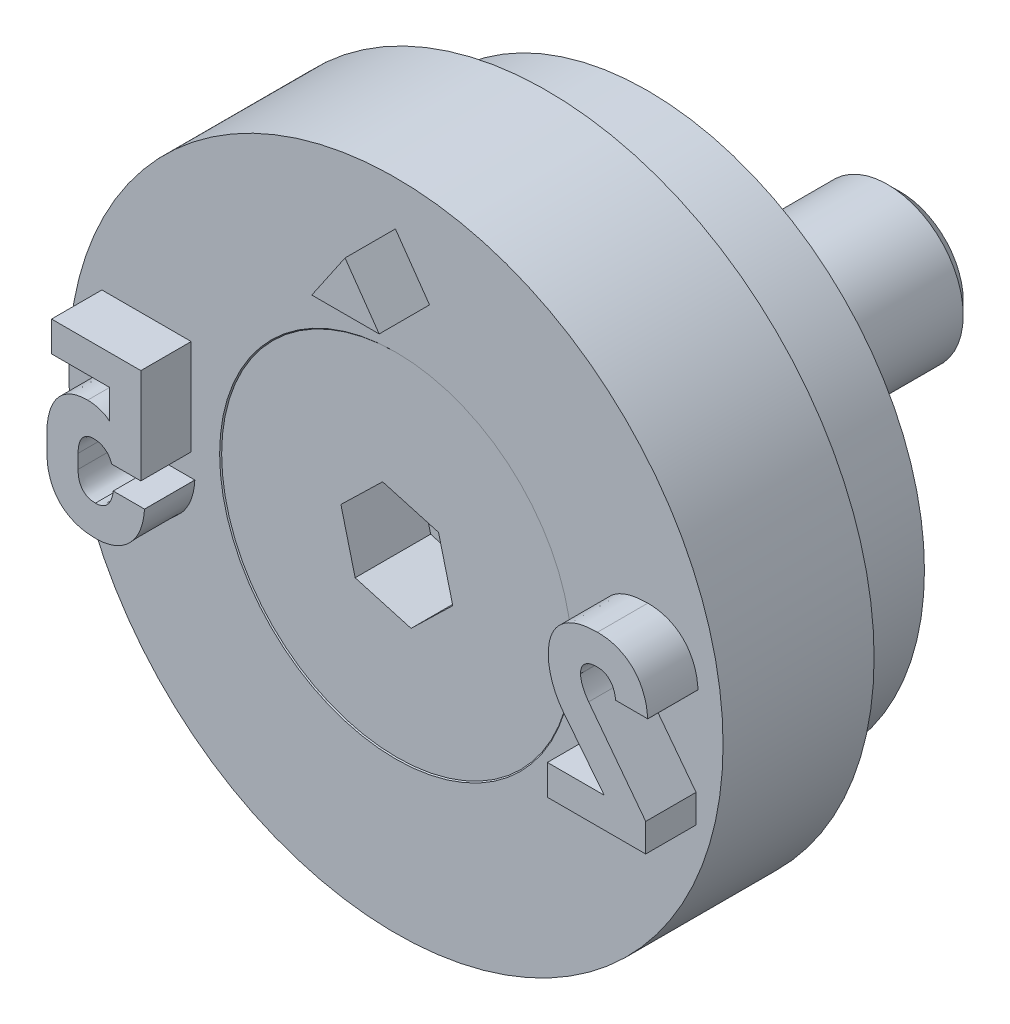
ISO-10303-21;
HEADER;
FILE_DESCRIPTION(('STEP AP214'),'2;1');
FILE_NAME('part.step','',(''),(''),'','','');
FILE_SCHEMA(('AUTOMOTIVE_DESIGN { 1 0 10303 214 1 1 1 1 }'));
ENDSEC;
DATA;
#1=APPLICATION_CONTEXT('core data for automotive mechanical design processes');
#2=APPLICATION_PROTOCOL_DEFINITION('international standard','automotive_design',2000,#1);
#3=PRODUCT_CONTEXT('',#1,'mechanical');
#4=PRODUCT('Part','Part','',(#3));
#5=PRODUCT_RELATED_PRODUCT_CATEGORY('part','',(#4));
#6=PRODUCT_DEFINITION_FORMATION('','',#4);
#7=PRODUCT_DEFINITION_CONTEXT('part definition',#1,'design');
#8=PRODUCT_DEFINITION('design','',#6,#7);
#9=PRODUCT_DEFINITION_SHAPE('','',#8);
#10=(LENGTH_UNIT() NAMED_UNIT(*) SI_UNIT(.MILLI.,.METRE.));
#11=(NAMED_UNIT(*) PLANE_ANGLE_UNIT() SI_UNIT($,.RADIAN.));
#12=(NAMED_UNIT(*) SI_UNIT($,.STERADIAN.) SOLID_ANGLE_UNIT());
#13=UNCERTAINTY_MEASURE_WITH_UNIT(LENGTH_MEASURE(1.E-05),#10,'distance_accuracy_value','');
#14=(GEOMETRIC_REPRESENTATION_CONTEXT(3) GLOBAL_UNCERTAINTY_ASSIGNED_CONTEXT((#13)) GLOBAL_UNIT_ASSIGNED_CONTEXT((#10,
#11,#12)) REPRESENTATION_CONTEXT('',''));
#15=CARTESIAN_POINT('',(0.,0.,0.));
#16=DIRECTION('',(0.,0.,1.));
#17=DIRECTION('',(1.,0.,0.));
#18=AXIS2_PLACEMENT_3D('',#15,#16,#17);
#19=CARTESIAN_POINT('',(0.,0.,-0.0200000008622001));
#20=DIRECTION('',(0.,0.,1.));
#21=DIRECTION('',(1.,0.,0.));
#22=AXIS2_PLACEMENT_3D('',#19,#20,#21);
#23=CYLINDRICAL_SURFACE('',#22,1.5);
#24=CARTESIAN_POINT('',(0.,0.,-2.0000000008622));
#25=DIRECTION('',(0.,0.,1.));
#26=DIRECTION('',(1.,0.,0.));
#27=AXIS2_PLACEMENT_3D('',#24,#25,#26);
#28=CIRCLE('',#27,1.5);
#29=CARTESIAN_POINT('',(1.5,0.,-2.0000000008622));
#30=VERTEX_POINT('',#29);
#31=EDGE_CURVE('E12',#30,#30,#28,.T.);
#32=ORIENTED_EDGE('',*,*,#31,.F.);
#33=EDGE_LOOP('',(#32));
#34=FACE_BOUND('',#33,.T.);
#35=CARTESIAN_POINT('',(0.,0.,-9.7700000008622));
#36=DIRECTION('',(0.,0.,1.));
#37=DIRECTION('',(1.,0.,0.));
#38=AXIS2_PLACEMENT_3D('',#35,#36,#37);
#39=CIRCLE('',#38,1.5);
#40=CARTESIAN_POINT('',(1.5,0.,-9.7700000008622));
#41=VERTEX_POINT('',#40);
#42=EDGE_CURVE('E146',#41,#41,#39,.T.);
#43=ORIENTED_EDGE('',*,*,#42,.T.);
#44=EDGE_LOOP('',(#43));
#45=FACE_BOUND('',#44,.T.);
#46=ADVANCED_FACE('F45',(#34,#45),#23,.T.);
#47=CARTESIAN_POINT('',(0.,0.,-2.0000000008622));
#48=DIRECTION('',(0.,0.,1.));
#49=DIRECTION('',(1.,0.,0.));
#50=AXIS2_PLACEMENT_3D('',#47,#48,#49);
#51=CONICAL_SURFACE('',#50,1.5,0.785398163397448);
#52=CARTESIAN_POINT('',(0.,0.,-0.0200000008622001));
#53=DIRECTION('',(0.,0.,1.));
#54=DIRECTION('',(1.,0.,0.));
#55=AXIS2_PLACEMENT_3D('',#52,#53,#54);
#56=CIRCLE('',#55,3.48);
#57=CARTESIAN_POINT('',(3.48,0.,-0.0200000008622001));
#58=VERTEX_POINT('',#57);
#59=EDGE_CURVE('E52',#58,#58,#56,.T.);
#60=ORIENTED_EDGE('',*,*,#59,.F.);
#61=EDGE_LOOP('',(#60));
#62=FACE_BOUND('',#61,.T.);
#63=ORIENTED_EDGE('',*,*,#31,.T.);
#64=EDGE_LOOP('',(#63));
#65=FACE_BOUND('',#64,.T.);
#66=ADVANCED_FACE('F161',(#62,#65),#51,.T.);
#67=CARTESIAN_POINT('',(0.,3.48,-0.0200000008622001));
#68=DIRECTION('',(0.,0.,-1.));
#69=DIRECTION('',(-1.,0.,0.));
#70=AXIS2_PLACEMENT_3D('',#67,#68,#69);
#71=PLANE('',#70);
#72=DIRECTION('',(0.962144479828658,-0.272539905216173,0.));
#73=VECTOR('',#72,1.);
#74=CARTESIAN_POINT('',(-0.828034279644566,-0.804793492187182,-0.0200000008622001));
#75=LINE('',#74,#73);
#76=CARTESIAN_POINT('',(-0.828034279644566,-0.804793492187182,-0.0200000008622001));
#77=VERTEX_POINT('',#76);
#78=CARTESIAN_POINT('',(0.282954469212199,-1.11949546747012,-0.0200000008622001));
#79=VERTEX_POINT('',#78);
#80=EDGE_CURVE('E133',#77,#79,#75,.T.);
#81=ORIENTED_EDGE('',*,*,#80,.F.);
#82=DIRECTION('',(0.245045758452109,-0.969511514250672,0.));
#83=VECTOR('',#82,1.);
#84=CARTESIAN_POINT('',(-1.11098874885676,0.314701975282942,-0.0200000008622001));
#85=LINE('',#84,#83);
#86=CARTESIAN_POINT('',(-1.11098874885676,0.314701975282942,-0.0200000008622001));
#87=VERTEX_POINT('',#86);
#88=EDGE_CURVE('E59',#87,#77,#85,.T.);
#89=ORIENTED_EDGE('',*,*,#88,.F.);
#90=DIRECTION('',(-0.717098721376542,-0.696971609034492,0.));
#91=VECTOR('',#90,1.);
#92=CARTESIAN_POINT('',(-0.282954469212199,1.11949546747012,-0.0200000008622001));
#93=LINE('',#92,#91);
#94=CARTESIAN_POINT('',(-0.282954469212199,1.11949546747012,-0.0200000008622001));
#95=VERTEX_POINT('',#94);
#96=EDGE_CURVE('E142',#95,#87,#93,.T.);
#97=ORIENTED_EDGE('',*,*,#96,.F.);
#98=DIRECTION('',(-0.962144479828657,0.272539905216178,0.));
#99=VECTOR('',#98,1.);
#100=CARTESIAN_POINT('',(0.828034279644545,0.804793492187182,-0.0200000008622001));
#101=LINE('',#100,#99);
#102=CARTESIAN_POINT('',(0.828034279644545,0.804793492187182,-0.0200000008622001));
#103=VERTEX_POINT('',#102);
#104=EDGE_CURVE('E140',#103,#95,#101,.T.);
#105=ORIENTED_EDGE('',*,*,#104,.F.);
#106=DIRECTION('',(-0.245045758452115,0.96951151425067,0.));
#107=VECTOR('',#106,1.);
#108=CARTESIAN_POINT('',(1.11098874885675,-0.314701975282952,-0.0200000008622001));
#109=LINE('',#108,#107);
#110=CARTESIAN_POINT('',(1.11098874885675,-0.314701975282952,-0.0200000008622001));
#111=VERTEX_POINT('',#110);
#112=EDGE_CURVE('E107',#111,#103,#109,.T.);
#113=ORIENTED_EDGE('',*,*,#112,.F.);
#114=DIRECTION('',(0.717098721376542,0.696971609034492,0.));
#115=VECTOR('',#114,1.);
#116=CARTESIAN_POINT('',(0.282954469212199,-1.11949546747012,-0.0200000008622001));
#117=LINE('',#116,#115);
#118=EDGE_CURVE('E136',#79,#111,#117,.T.);
#119=ORIENTED_EDGE('',*,*,#118,.F.);
#120=EDGE_LOOP('',(#81,#89,#97,#105,#113,#119));
#121=FACE_BOUND('',#120,.T.);
#122=ORIENTED_EDGE('',*,*,#59,.T.);
#123=EDGE_LOOP('',(#122));
#124=FACE_BOUND('',#123,.T.);
#125=ADVANCED_FACE('F159',(#121,#124),#71,.F.);
#126=CARTESIAN_POINT('',(0.,0.,-10.0200000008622));
#127=DIRECTION('',(0.,0.,1.));
#128=DIRECTION('',(1.,0.,0.));
#129=AXIS2_PLACEMENT_3D('',#126,#127,#128);
#130=PLANE('',#129);
#131=CARTESIAN_POINT('',(0.,0.,-10.0200000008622));
#132=DIRECTION('',(0.,0.,1.));
#133=DIRECTION('',(1.,0.,0.));
#134=AXIS2_PLACEMENT_3D('',#131,#132,#133);
#135=CIRCLE('',#134,1.25);
#136=CARTESIAN_POINT('',(1.25,0.,-10.0200000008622));
#137=VERTEX_POINT('',#136);
#138=EDGE_CURVE('E154',#137,#137,#135,.T.);
#139=ORIENTED_EDGE('',*,*,#138,.F.);
#140=EDGE_LOOP('',(#139));
#141=FACE_BOUND('',#140,.T.);
#142=ADVANCED_FACE('F174',(#141),#130,.F.);
#143=CARTESIAN_POINT('',(0.,0.,-10.0200000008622));
#144=DIRECTION('',(0.,0.,1.));
#145=DIRECTION('',(1.,0.,0.));
#146=AXIS2_PLACEMENT_3D('',#143,#144,#145);
#147=CONICAL_SURFACE('',#146,1.25,0.78539816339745);
#148=ORIENTED_EDGE('',*,*,#42,.F.);
#149=EDGE_LOOP('',(#148));
#150=FACE_BOUND('',#149,.T.);
#151=ORIENTED_EDGE('',*,*,#138,.T.);
#152=EDGE_LOOP('',(#151));
#153=FACE_BOUND('',#152,.T.);
#154=ADVANCED_FACE('F170',(#150,#153),#147,.T.);
#155=CARTESIAN_POINT('',(-1.11098874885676,0.314701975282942,-1.5200000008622));
#156=DIRECTION('',(-0.969511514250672,-0.245045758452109,0.));
#157=DIRECTION('',(0.245045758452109,-0.969511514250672,0.));
#158=AXIS2_PLACEMENT_3D('',#155,#156,#157);
#159=PLANE('',#158);
#160=ORIENTED_EDGE('',*,*,#88,.T.);
#161=DIRECTION('',(0.,0.,1.));
#162=VECTOR('',#161,1.);
#163=CARTESIAN_POINT('',(-0.828034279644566,-0.804793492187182,-1.5200000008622));
#164=LINE('',#163,#162);
#165=CARTESIAN_POINT('',(-0.828034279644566,-0.804793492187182,-1.5200000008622));
#166=VERTEX_POINT('',#165);
#167=EDGE_CURVE('E89',#166,#77,#164,.T.);
#168=ORIENTED_EDGE('',*,*,#167,.F.);
#169=DIRECTION('',(0.245045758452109,-0.969511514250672,0.));
#170=VECTOR('',#169,1.);
#171=CARTESIAN_POINT('',(-1.11098874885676,0.314701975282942,-1.5200000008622));
#172=LINE('',#171,#170);
#173=CARTESIAN_POINT('',(-1.11098874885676,0.314701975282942,-1.5200000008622));
#174=VERTEX_POINT('',#173);
#175=EDGE_CURVE('E144',#174,#166,#172,.T.);
#176=ORIENTED_EDGE('',*,*,#175,.F.);
#177=DIRECTION('',(0.,0.,1.));
#178=VECTOR('',#177,1.);
#179=CARTESIAN_POINT('',(-1.11098874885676,0.314701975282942,-1.5200000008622));
#180=LINE('',#179,#178);
#181=EDGE_CURVE('E67',#174,#87,#180,.T.);
#182=ORIENTED_EDGE('',*,*,#181,.T.);
#183=EDGE_LOOP('',(#160,#168,#176,#182));
#184=FACE_BOUND('',#183,.T.);
#185=ADVANCED_FACE('F173',(#184),#159,.F.);
#186=CARTESIAN_POINT('',(-0.282954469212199,1.11949546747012,-1.5200000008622));
#187=DIRECTION('',(-0.696971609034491,0.717098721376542,0.));
#188=DIRECTION('',(-0.717098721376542,-0.696971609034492,0.));
#189=AXIS2_PLACEMENT_3D('',#186,#187,#188);
#190=PLANE('',#189);
#191=ORIENTED_EDGE('',*,*,#96,.T.);
#192=ORIENTED_EDGE('',*,*,#181,.F.);
#193=DIRECTION('',(-0.717098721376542,-0.696971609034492,0.));
#194=VECTOR('',#193,1.);
#195=CARTESIAN_POINT('',(-0.282954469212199,1.11949546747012,-1.5200000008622));
#196=LINE('',#195,#194);
#197=CARTESIAN_POINT('',(-0.282954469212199,1.11949546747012,-1.5200000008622));
#198=VERTEX_POINT('',#197);
#199=EDGE_CURVE('E119',#198,#174,#196,.T.);
#200=ORIENTED_EDGE('',*,*,#199,.F.);
#201=DIRECTION('',(0.,0.,1.));
#202=VECTOR('',#201,1.);
#203=CARTESIAN_POINT('',(-0.282954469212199,1.11949546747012,-1.5200000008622));
#204=LINE('',#203,#202);
#205=EDGE_CURVE('E111',#198,#95,#204,.T.);
#206=ORIENTED_EDGE('',*,*,#205,.T.);
#207=EDGE_LOOP('',(#191,#192,#200,#206));
#208=FACE_BOUND('',#207,.T.);
#209=ADVANCED_FACE('F189',(#208),#190,.F.);
#210=CARTESIAN_POINT('',(0.828034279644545,0.804793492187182,-1.5200000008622));
#211=DIRECTION('',(0.272539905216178,0.962144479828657,0.));
#212=DIRECTION('',(-0.962144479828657,0.272539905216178,0.));
#213=AXIS2_PLACEMENT_3D('',#210,#211,#212);
#214=PLANE('',#213);
#215=ORIENTED_EDGE('',*,*,#104,.T.);
#216=ORIENTED_EDGE('',*,*,#205,.F.);
#217=DIRECTION('',(-0.962144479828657,0.272539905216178,0.));
#218=VECTOR('',#217,1.);
#219=CARTESIAN_POINT('',(0.828034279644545,0.804793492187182,-1.5200000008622));
#220=LINE('',#219,#218);
#221=CARTESIAN_POINT('',(0.828034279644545,0.804793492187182,-1.5200000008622));
#222=VERTEX_POINT('',#221);
#223=EDGE_CURVE('E115',#222,#198,#220,.T.);
#224=ORIENTED_EDGE('',*,*,#223,.F.);
#225=DIRECTION('',(0.,0.,1.));
#226=VECTOR('',#225,1.);
#227=CARTESIAN_POINT('',(0.828034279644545,0.804793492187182,-1.5200000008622));
#228=LINE('',#227,#226);
#229=EDGE_CURVE('E100',#222,#103,#228,.T.);
#230=ORIENTED_EDGE('',*,*,#229,.T.);
#231=EDGE_LOOP('',(#215,#216,#224,#230));
#232=FACE_BOUND('',#231,.T.);
#233=ADVANCED_FACE('F116',(#232),#214,.F.);
#234=CARTESIAN_POINT('',(1.11098874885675,-0.314701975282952,-1.5200000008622));
#235=DIRECTION('',(0.96951151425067,0.245045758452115,0.));
#236=DIRECTION('',(-0.245045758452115,0.96951151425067,0.));
#237=AXIS2_PLACEMENT_3D('',#234,#235,#236);
#238=PLANE('',#237);
#239=ORIENTED_EDGE('',*,*,#112,.T.);
#240=ORIENTED_EDGE('',*,*,#229,.F.);
#241=DIRECTION('',(-0.245045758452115,0.96951151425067,0.));
#242=VECTOR('',#241,1.);
#243=CARTESIAN_POINT('',(1.11098874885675,-0.314701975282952,-1.5200000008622));
#244=LINE('',#243,#242);
#245=CARTESIAN_POINT('',(1.11098874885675,-0.314701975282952,-1.5200000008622));
#246=VERTEX_POINT('',#245);
#247=EDGE_CURVE('E104',#246,#222,#244,.T.);
#248=ORIENTED_EDGE('',*,*,#247,.F.);
#249=DIRECTION('',(0.,0.,1.));
#250=VECTOR('',#249,1.);
#251=CARTESIAN_POINT('',(1.11098874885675,-0.314701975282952,-1.5200000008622));
#252=LINE('',#251,#250);
#253=EDGE_CURVE('E112',#246,#111,#252,.T.);
#254=ORIENTED_EDGE('',*,*,#253,.T.);
#255=EDGE_LOOP('',(#239,#240,#248,#254));
#256=FACE_BOUND('',#255,.T.);
#257=ADVANCED_FACE('F102',(#256),#238,.F.);
#258=CARTESIAN_POINT('',(0.282954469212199,-1.11949546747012,-1.5200000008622));
#259=DIRECTION('',(0.696971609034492,-0.717098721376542,0.));
#260=DIRECTION('',(0.717098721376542,0.696971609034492,0.));
#261=AXIS2_PLACEMENT_3D('',#258,#259,#260);
#262=PLANE('',#261);
#263=ORIENTED_EDGE('',*,*,#118,.T.);
#264=ORIENTED_EDGE('',*,*,#253,.F.);
#265=DIRECTION('',(0.717098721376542,0.696971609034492,0.));
#266=VECTOR('',#265,1.);
#267=CARTESIAN_POINT('',(0.282954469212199,-1.11949546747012,-1.5200000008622));
#268=LINE('',#267,#266);
#269=CARTESIAN_POINT('',(0.282954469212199,-1.11949546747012,-1.5200000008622));
#270=VERTEX_POINT('',#269);
#271=EDGE_CURVE('E125',#270,#246,#268,.T.);
#272=ORIENTED_EDGE('',*,*,#271,.F.);
#273=DIRECTION('',(0.,0.,1.));
#274=VECTOR('',#273,1.);
#275=CARTESIAN_POINT('',(0.282954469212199,-1.11949546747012,-1.5200000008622));
#276=LINE('',#275,#274);
#277=EDGE_CURVE('E149',#270,#79,#276,.T.);
#278=ORIENTED_EDGE('',*,*,#277,.T.);
#279=EDGE_LOOP('',(#263,#264,#272,#278));
#280=FACE_BOUND('',#279,.T.);
#281=ADVANCED_FACE('F193',(#280),#262,.F.);
#282=CARTESIAN_POINT('',(-0.828034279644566,-0.804793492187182,-1.5200000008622));
#283=DIRECTION('',(-0.272539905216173,-0.962144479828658,0.));
#284=DIRECTION('',(0.962144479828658,-0.272539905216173,0.));
#285=AXIS2_PLACEMENT_3D('',#282,#283,#284);
#286=PLANE('',#285);
#287=ORIENTED_EDGE('',*,*,#80,.T.);
#288=ORIENTED_EDGE('',*,*,#277,.F.);
#289=DIRECTION('',(0.962144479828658,-0.272539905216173,0.));
#290=VECTOR('',#289,1.);
#291=CARTESIAN_POINT('',(-0.828034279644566,-0.804793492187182,-1.5200000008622));
#292=LINE('',#291,#290);
#293=EDGE_CURVE('E127',#166,#270,#292,.T.);
#294=ORIENTED_EDGE('',*,*,#293,.F.);
#295=ORIENTED_EDGE('',*,*,#167,.T.);
#296=EDGE_LOOP('',(#287,#288,#294,#295));
#297=FACE_BOUND('',#296,.T.);
#298=ADVANCED_FACE('F190',(#297),#286,.F.);
#299=CARTESIAN_POINT('',(0.,0.,-1.5200000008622));
#300=DIRECTION('',(0.,0.,1.));
#301=DIRECTION('',(1.,0.,0.));
#302=AXIS2_PLACEMENT_3D('',#299,#300,#301);
#303=PLANE('',#302);
#304=ORIENTED_EDGE('',*,*,#175,.T.);
#305=ORIENTED_EDGE('',*,*,#293,.T.);
#306=ORIENTED_EDGE('',*,*,#271,.T.);
#307=ORIENTED_EDGE('',*,*,#247,.T.);
#308=ORIENTED_EDGE('',*,*,#223,.T.);
#309=ORIENTED_EDGE('',*,*,#199,.T.);
#310=EDGE_LOOP('',(#304,#305,#306,#307,#308,#309));
#311=FACE_BOUND('',#310,.T.);
#312=ADVANCED_FACE('F122',(#311),#303,.T.);
#313=CLOSED_SHELL('',(#46,#66,#125,#142,#154,#185,#209,#233,#257,#281,#298,#312));
#314=MANIFOLD_SOLID_BREP('B2',#313);
#315=CARTESIAN_POINT('',(0.,6.5,0.));
#316=DIRECTION('',(0.,0.,-1.));
#317=DIRECTION('',(-1.,0.,0.));
#318=AXIS2_PLACEMENT_3D('',#315,#316,#317);
#319=PLANE('',#318);
#320=CARTESIAN_POINT('',(-5.93327117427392,-0.671906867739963,0.));
#321=CARTESIAN_POINT('',(-5.93179710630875,-0.723334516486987,0.));
#322=CARTESIAN_POINT('',(-5.92894547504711,-0.822822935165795,0.));
#323=CARTESIAN_POINT('',(-5.90855332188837,-0.966690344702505,0.));
#324=CARTESIAN_POINT('',(-5.87179203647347,-1.09865865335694,0.));
#325=CARTESIAN_POINT('',(-5.82253732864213,-1.21958105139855,0.));
#326=CARTESIAN_POINT('',(-5.75822094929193,-1.32705459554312,0.));
#327=CARTESIAN_POINT('',(-5.68120590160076,-1.42198715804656,0.));
#328=CARTESIAN_POINT('',(-5.59008673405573,-1.50218685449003,0.));
#329=CARTESIAN_POINT('',(-5.48701391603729,-1.56968167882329,0.));
#330=CARTESIAN_POINT('',(-5.37100671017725,-1.62144551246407,0.));
#331=CARTESIAN_POINT('',(-5.24391891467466,-1.65905024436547,0.));
#332=CARTESIAN_POINT('',(-5.1052476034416,-1.68141771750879,0.));
#333=CARTESIAN_POINT('',(-5.00921719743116,-1.68398910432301,0.));
#334=CARTESIAN_POINT('',(-4.95956137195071,-1.68531872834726,0.));
#335=B_SPLINE_CURVE_WITH_KNOTS('',3,(#320,#321,#322,#323,#324,#325,#326,#327,#328,#329,#330,
#331,#332,#333,#334),.UNSPECIFIED.,.F.,.F.,(4,1,1,1,1,1,1,1,1,1,1,1,4),(0.,0.0965919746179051,
0.1868602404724,0.272108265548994,0.353324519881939,0.431359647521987,0.506505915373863,
0.582010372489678,0.658435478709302,0.737063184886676,0.819709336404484,0.906774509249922,1.),.UNSPECIFIED.);
#336=CARTESIAN_POINT('',(-5.93327117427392,-0.671906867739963,0.));
#337=VERTEX_POINT('',#336);
#338=CARTESIAN_POINT('',(-4.95956137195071,-1.68531872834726,0.));
#339=VERTEX_POINT('',#338);
#340=EDGE_CURVE('E526',#337,#339,#335,.T.);
#341=ORIENTED_EDGE('',*,*,#340,.F.);
#342=DIRECTION('',(0.,-1.,0.));
#343=VECTOR('',#342,1.);
#344=CARTESIAN_POINT('',(-5.93327117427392,-0.395338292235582,0.));
#345=LINE('',#344,#343);
#346=CARTESIAN_POINT('',(-5.93327117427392,-0.395338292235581,0.));
#347=VERTEX_POINT('',#346);
#348=EDGE_CURVE('E542',#347,#337,#345,.T.);
#349=ORIENTED_EDGE('',*,*,#348,.F.);
#350=CARTESIAN_POINT('',(-5.12038835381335,0.615381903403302,0.));
#351=CARTESIAN_POINT('',(-5.16177174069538,0.614071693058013,0.));
#352=CARTESIAN_POINT('',(-5.24203407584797,0.611530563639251,0.));
#353=CARTESIAN_POINT('',(-5.35780595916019,0.588672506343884,0.));
#354=CARTESIAN_POINT('',(-5.46450050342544,0.552051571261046,0.));
#355=CARTESIAN_POINT('',(-5.561237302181,0.499291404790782,0.));
#356=CARTESIAN_POINT('',(-5.64812578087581,0.433164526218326,0.));
#357=CARTESIAN_POINT('',(-5.72359498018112,0.352362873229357,0.));
#358=CARTESIAN_POINT('',(-5.78811536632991,0.258203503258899,0.));
#359=CARTESIAN_POINT('',(-5.84091977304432,0.150623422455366,0.));
#360=CARTESIAN_POINT('',(-5.88247906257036,0.0305653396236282,0.));
#361=CARTESIAN_POINT('',(-5.91266482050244,-0.10113240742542,0.));
#362=CARTESIAN_POINT('',(-5.92986699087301,-0.244597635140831,0.));
#363=CARTESIAN_POINT('',(-5.93211012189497,-0.343925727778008,0.));
#364=CARTESIAN_POINT('',(-5.93327117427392,-0.395338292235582,0.));
#365=B_SPLINE_CURVE_WITH_KNOTS('',3,(#350,#351,#352,#353,#354,#355,#356,#357,#358,#359,#360,
#361,#362,#363,#364),.UNSPECIFIED.,.F.,.F.,(4,1,1,1,1,1,1,1,1,1,1,1,4),(0.,0.0843949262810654,
0.163682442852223,0.239848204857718,0.313806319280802,0.387615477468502,0.461788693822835,
0.538496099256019,0.61978489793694,0.705652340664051,0.797279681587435,0.895071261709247,1.),.UNSPECIFIED.);
#366=CARTESIAN_POINT('',(-5.12038835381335,0.615381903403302,0.));
#367=VERTEX_POINT('',#366);
#368=EDGE_CURVE('E888',#367,#347,#365,.T.);
#369=ORIENTED_EDGE('',*,*,#368,.F.);
#370=CARTESIAN_POINT('',(-4.68703029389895,0.468013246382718,0.));
#371=CARTESIAN_POINT('',(-4.69955810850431,0.479106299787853,0.));
#372=CARTESIAN_POINT('',(-4.72532880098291,0.50192557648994,0.));
#373=CARTESIAN_POINT('',(-4.7703833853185,0.530899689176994,0.));
#374=CARTESIAN_POINT('',(-4.82191200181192,0.555508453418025,0.));
#375=CARTESIAN_POINT('',(-4.89794725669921,0.583851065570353,0.));
#376=CARTESIAN_POINT('',(-4.99796835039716,0.609054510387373,0.));
#377=CARTESIAN_POINT('',(-5.08007866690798,0.613298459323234,0.));
#378=CARTESIAN_POINT('',(-5.12038835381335,0.615381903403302,0.));
#379=B_SPLINE_CURVE_WITH_KNOTS('',3,(#370,#371,#372,#373,#374,#375,#376,#377,#378),
.UNSPECIFIED.,.F.,.F.,(4,1,1,1,1,1,4),(0.,0.107291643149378,0.220707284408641,0.342410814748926,
0.473179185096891,0.74137254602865,1.),.UNSPECIFIED.);
#380=CARTESIAN_POINT('',(-4.68703029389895,0.468013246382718,0.));
#381=VERTEX_POINT('',#380);
#382=EDGE_CURVE('E883',#381,#367,#379,.T.);
#383=ORIENTED_EDGE('',*,*,#382,.F.);
#384=DIRECTION('',(0.,-1.,0.));
#385=VECTOR('',#384,1.);
#386=CARTESIAN_POINT('',(-4.68703029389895,1.05143162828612,0.));
#387=LINE('',#386,#385);
#388=CARTESIAN_POINT('',(-4.68703029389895,1.05143162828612,0.));
#389=VERTEX_POINT('',#388);
#390=EDGE_CURVE('E880',#389,#381,#387,.T.);
#391=ORIENTED_EDGE('',*,*,#390,.F.);
#392=DIRECTION('',(1.,0.,0.));
#393=VECTOR('',#392,1.);
#394=CARTESIAN_POINT('',(-5.83838998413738,1.05143162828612,0.));
#395=LINE('',#394,#393);
#396=CARTESIAN_POINT('',(-5.83838998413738,1.05143162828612,0.));
#397=VERTEX_POINT('',#396);
#398=EDGE_CURVE('E877',#397,#389,#395,.T.);
#399=ORIENTED_EDGE('',*,*,#398,.F.);
#400=DIRECTION('',(0.,-1.,0.));
#401=VECTOR('',#400,1.);
#402=CARTESIAN_POINT('',(-5.83838998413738,1.651,0.));
#403=LINE('',#402,#401);
#404=CARTESIAN_POINT('',(-5.83838998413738,1.651,0.));
#405=VERTEX_POINT('',#404);
#406=EDGE_CURVE('E874',#405,#397,#403,.T.);
#407=ORIENTED_EDGE('',*,*,#406,.F.);
#408=DIRECTION('',(-1.,0.,0.));
#409=VECTOR('',#408,1.);
#410=CARTESIAN_POINT('',(-4.06458276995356,1.651,0.));
#411=LINE('',#410,#409);
#412=CARTESIAN_POINT('',(-4.06458276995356,1.651,0.));
#413=VERTEX_POINT('',#412);
#414=EDGE_CURVE('E871',#413,#405,#411,.T.);
#415=ORIENTED_EDGE('',*,*,#414,.F.);
#416=DIRECTION('',(0.,1.,0.));
#417=VECTOR('',#416,1.);
#418=CARTESIAN_POINT('',(-4.06458276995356,-0.247296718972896,0.));
#419=LINE('',#418,#417);
#420=CARTESIAN_POINT('',(-4.06458276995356,-0.247296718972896,0.));
#421=VERTEX_POINT('',#420);
#422=EDGE_CURVE('E868',#421,#413,#419,.T.);
#423=ORIENTED_EDGE('',*,*,#422,.F.);
#424=DIRECTION('',(1.,0.,0.));
#425=VECTOR('',#424,1.);
#426=CARTESIAN_POINT('',(-4.64598240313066,-0.247296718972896,0.));
#427=LINE('',#426,#425);
#428=CARTESIAN_POINT('',(-4.64598240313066,-0.247296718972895,0.));
#429=VERTEX_POINT('',#428);
#430=EDGE_CURVE('E862',#429,#421,#427,.T.);
#431=ORIENTED_EDGE('',*,*,#430,.F.);
#432=CARTESIAN_POINT('',(-5.00464676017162,0.0117760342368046,0.));
#433=CARTESIAN_POINT('',(-4.98304285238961,0.0111171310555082,0.));
#434=CARTESIAN_POINT('',(-4.94121848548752,0.0098415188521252,0.));
#435=CARTESIAN_POINT('',(-4.88099794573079,-0.00336678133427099,0.));
#436=CARTESIAN_POINT('',(-4.82564932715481,-0.024977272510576,0.));
#437=CARTESIAN_POINT('',(-4.77580094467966,-0.0555310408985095,0.));
#438=CARTESIAN_POINT('',(-4.73177394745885,-0.0929784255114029,0.));
#439=CARTESIAN_POINT('',(-4.69552592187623,-0.138226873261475,0.));
#440=CARTESIAN_POINT('',(-4.66513972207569,-0.189355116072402,0.));
#441=CARTESIAN_POINT('',(-4.65246096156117,-0.227702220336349,0.));
#442=CARTESIAN_POINT('',(-4.64598240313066,-0.247296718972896,0.));
#443=B_SPLINE_CURVE_WITH_KNOTS('',3,(#432,#433,#434,#435,#436,#437,#438,#439,#440,#441,#442),
.UNSPECIFIED.,.F.,.F.,(4,1,1,1,1,1,1,1,4),(0.,0.135635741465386,0.262585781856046,
0.385395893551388,0.507524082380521,0.628507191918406,0.746772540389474,0.870606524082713,1.),.UNSPECIFIED.);
#444=CARTESIAN_POINT('',(-5.00464676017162,0.0117760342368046,0.));
#445=VERTEX_POINT('',#444);
#446=EDGE_CURVE('E854',#445,#429,#443,.T.);
#447=ORIENTED_EDGE('',*,*,#446,.F.);
#448=CARTESIAN_POINT('',(-5.31149656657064,-0.395338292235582,0.));
#449=CARTESIAN_POINT('',(-5.31083199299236,-0.364526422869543,0.));
#450=CARTESIAN_POINT('',(-5.30957072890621,-0.306049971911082,0.));
#451=CARTESIAN_POINT('',(-5.29388065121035,-0.224250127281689,0.));
#452=CARTESIAN_POINT('',(-5.26948568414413,-0.152882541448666,0.));
#453=CARTESIAN_POINT('',(-5.23345771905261,-0.0936381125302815,0.));
#454=CARTESIAN_POINT('',(-5.18867125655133,-0.0458186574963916,0.));
#455=CARTESIAN_POINT('',(-5.13447410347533,-0.0118554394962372,0.));
#456=CARTESIAN_POINT('',(-5.07195482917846,0.00820365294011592,0.));
#457=CARTESIAN_POINT('',(-5.02767692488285,0.010553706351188,0.));
#458=CARTESIAN_POINT('',(-5.00464676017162,0.0117760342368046,0.));
#459=B_SPLINE_CURVE_WITH_KNOTS('',3,(#448,#449,#450,#451,#452,#453,#454,#455,#456,#457,#458),
.UNSPECIFIED.,.F.,.F.,(4,1,1,1,1,1,1,1,4),(0.,0.160198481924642,0.304033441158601,
0.431843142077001,0.550810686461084,0.662316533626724,0.769888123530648,0.880312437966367,1.),.UNSPECIFIED.);
#460=CARTESIAN_POINT('',(-5.31149656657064,-0.395338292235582,0.));
#461=VERTEX_POINT('',#460);
#462=EDGE_CURVE('E849',#461,#445,#459,.T.);
#463=ORIENTED_EDGE('',*,*,#462,.F.);
#464=DIRECTION('',(0.,1.,0.));
#465=VECTOR('',#464,1.);
#466=CARTESIAN_POINT('',(-5.31149656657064,-0.671906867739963,0.));
#467=LINE('',#466,#465);
#468=CARTESIAN_POINT('',(-5.31149656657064,-0.671906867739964,0.));
#469=VERTEX_POINT('',#468);
#470=EDGE_CURVE('E843',#469,#461,#467,.T.);
#471=ORIENTED_EDGE('',*,*,#470,.F.);
#472=CARTESIAN_POINT('',(-4.96830928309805,-1.08103994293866,0.));
#473=CARTESIAN_POINT('',(-4.99426187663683,-1.07990932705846,0.));
#474=CARTESIAN_POINT('',(-5.04390245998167,-1.0777467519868,0.));
#475=CARTESIAN_POINT('',(-5.11348195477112,-1.0568747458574,0.));
#476=CARTESIAN_POINT('',(-5.17405353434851,-1.02345853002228,0.));
#477=CARTESIAN_POINT('',(-5.22408575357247,-0.975374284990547,0.));
#478=CARTESIAN_POINT('',(-5.26399871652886,-0.915461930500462,0.));
#479=CARTESIAN_POINT('',(-5.29225140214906,-0.843716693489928,0.));
#480=CARTESIAN_POINT('',(-5.30898354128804,-0.761277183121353,0.));
#481=CARTESIAN_POINT('',(-5.31063010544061,-0.702720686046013,0.));
#482=CARTESIAN_POINT('',(-5.31149656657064,-0.671906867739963,0.));
#483=B_SPLINE_CURVE_WITH_KNOTS('',3,(#472,#473,#474,#475,#476,#477,#478,#479,#480,#481,#482),
.UNSPECIFIED.,.F.,.F.,(4,1,1,1,1,1,1,1,4),(0.,0.128261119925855,0.245330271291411,
0.356275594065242,0.467886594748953,0.585607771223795,0.710231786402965,0.847517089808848,1.),.UNSPECIFIED.);
#484=CARTESIAN_POINT('',(-4.96830928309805,-1.08103994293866,0.));
#485=VERTEX_POINT('',#484);
#486=EDGE_CURVE('E835',#485,#469,#483,.T.);
#487=ORIENTED_EDGE('',*,*,#486,.F.);
#488=CARTESIAN_POINT('',(-4.61435533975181,-0.696804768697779,0.));
#489=CARTESIAN_POINT('',(-4.61790871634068,-0.725706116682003,0.));
#490=CARTESIAN_POINT('',(-4.62468052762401,-0.780784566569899,0.));
#491=CARTESIAN_POINT('',(-4.64909971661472,-0.857217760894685,0.));
#492=CARTESIAN_POINT('',(-4.68098054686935,-0.924402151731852,0.));
#493=CARTESIAN_POINT('',(-4.72309261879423,-0.980775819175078,0.));
#494=CARTESIAN_POINT('',(-4.773100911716,-1.02654320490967,0.));
#495=CARTESIAN_POINT('',(-4.83235907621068,-1.05758373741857,0.));
#496=CARTESIAN_POINT('',(-4.89785135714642,-1.07829675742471,0.));
#497=CARTESIAN_POINT('',(-4.94436590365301,-1.08010773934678,0.));
#498=CARTESIAN_POINT('',(-4.96830928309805,-1.08103994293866,0.));
#499=B_SPLINE_CURVE_WITH_KNOTS('',3,(#488,#489,#490,#491,#492,#493,#494,#495,#496,#497,#498),
.UNSPECIFIED.,.F.,.F.,(4,1,1,1,1,1,1,1,4),(0.,0.150277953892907,0.286390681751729,
0.412971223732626,0.533144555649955,0.648163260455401,0.760273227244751,0.87660055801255,1.),.UNSPECIFIED.);
#500=CARTESIAN_POINT('',(-4.61435533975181,-0.696804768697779,0.));
#501=VERTEX_POINT('',#500);
#502=EDGE_CURVE('E830',#501,#485,#499,.T.);
#503=ORIENTED_EDGE('',*,*,#502,.F.);
#504=DIRECTION('',(0.,-1.,0.));
#505=VECTOR('',#504,1.);
#506=CARTESIAN_POINT('',(-4.61435533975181,-0.694786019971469,0.));
#507=LINE('',#506,#505);
#508=CARTESIAN_POINT('',(-4.61435533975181,-0.694786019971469,0.));
#509=VERTEX_POINT('',#508);
#510=EDGE_CURVE('E827',#509,#501,#507,.T.);
#511=ORIENTED_EDGE('',*,*,#510,.F.);
#512=DIRECTION('',(-1.,0.,0.));
#513=VECTOR('',#512,1.);
#514=CARTESIAN_POINT('',(-3.99190781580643,-0.694786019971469,0.));
#515=LINE('',#514,#513);
#516=CARTESIAN_POINT('',(-3.99190781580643,-0.694786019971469,0.));
#517=VERTEX_POINT('',#516);
#518=EDGE_CURVE('E824',#517,#509,#515,.T.);
#519=ORIENTED_EDGE('',*,*,#518,.F.);
#520=DIRECTION('',(0.,1.,0.));
#521=VECTOR('',#520,1.);
#522=CARTESIAN_POINT('',(-3.99190781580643,-0.696804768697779,0.));
#523=LINE('',#522,#521);
#524=CARTESIAN_POINT('',(-3.99190781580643,-0.696804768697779,0.));
#525=VERTEX_POINT('',#524);
#526=EDGE_CURVE('E818',#525,#517,#523,.T.);
#527=ORIENTED_EDGE('',*,*,#526,.F.);
#528=CARTESIAN_POINT('',(-4.95956137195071,-1.68531872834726,0.));
#529=CARTESIAN_POINT('',(-4.91616322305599,-1.68399471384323,0.));
#530=CARTESIAN_POINT('',(-4.83124049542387,-1.68140384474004,0.));
#531=CARTESIAN_POINT('',(-4.70745335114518,-1.65814497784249,0.));
#532=CARTESIAN_POINT('',(-4.59009911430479,-1.62212440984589,0.));
#533=CARTESIAN_POINT('',(-4.48005042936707,-1.57073861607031,0.));
#534=CARTESIAN_POINT('',(-4.37850308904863,-1.50545449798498,0.));
#535=CARTESIAN_POINT('',(-4.28770209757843,-1.42562327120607,0.));
#536=CARTESIAN_POINT('',(-4.20681459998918,-1.3333350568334,0.));
#537=CARTESIAN_POINT('',(-4.13746259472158,-1.22778199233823,0.));
#538=CARTESIAN_POINT('',(-4.08034843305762,-1.11009327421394,0.));
#539=CARTESIAN_POINT('',(-4.03588406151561,-0.981655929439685,0.));
#540=CARTESIAN_POINT('',(-4.00534418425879,-0.842700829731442,0.));
#541=CARTESIAN_POINT('',(-3.99646575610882,-0.74629623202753,0.));
#542=CARTESIAN_POINT('',(-3.99190781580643,-0.696804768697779,0.));
#543=B_SPLINE_CURVE_WITH_KNOTS('',3,(#528,#529,#530,#531,#532,#533,#534,#535,#536,#537,#538,
#539,#540,#541,#542),.UNSPECIFIED.,.F.,.F.,(4,1,1,1,1,1,1,1,1,1,1,1,4),(0.,0.0844304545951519,
0.165215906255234,0.244369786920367,0.322918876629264,0.400936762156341,0.47863123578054,
0.557558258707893,0.63920335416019,0.723781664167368,0.811629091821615,0.903295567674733,1.),.UNSPECIFIED.);
#544=EDGE_CURVE('E529',#339,#525,#543,.T.);
#545=ORIENTED_EDGE('',*,*,#544,.F.);
#546=EDGE_LOOP('',(#341,#349,#369,#383,#391,#399,#407,#415,#423,#431,#447,#463,#471,#487,#503,
#511,#519,#527,#545));
#547=FACE_BOUND('',#546,.T.);
#548=CARTESIAN_POINT('',(0.,0.,0.));
#549=DIRECTION('',(0.,0.,1.));
#550=DIRECTION('',(1.,0.,0.));
#551=AXIS2_PLACEMENT_3D('',#548,#549,#550);
#552=CIRCLE('',#551,6.5);
#553=CARTESIAN_POINT('',(6.5,0.,0.));
#554=VERTEX_POINT('',#553);
#555=EDGE_CURVE('E43',#554,#554,#552,.T.);
#556=ORIENTED_EDGE('',*,*,#555,.T.);
#557=EDGE_LOOP('',(#556));
#558=FACE_BOUND('',#557,.T.);
#559=CARTESIAN_POINT('',(0.,0.,0.));
#560=DIRECTION('',(0.,0.,1.));
#561=DIRECTION('',(1.,0.,0.));
#562=AXIS2_PLACEMENT_3D('',#559,#560,#561);
#563=CIRCLE('',#562,3.5000000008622);
#564=CARTESIAN_POINT('',(3.5000000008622,0.,0.));
#565=VERTEX_POINT('',#564);
#566=EDGE_CURVE('E265',#565,#565,#563,.T.);
#567=ORIENTED_EDGE('',*,*,#566,.F.);
#568=EDGE_LOOP('',(#567));
#569=FACE_BOUND('',#568,.T.);
#570=DIRECTION('',(0.,1.,0.));
#571=VECTOR('',#570,1.);
#572=CARTESIAN_POINT('',(5.9632150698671,-1.651,0.));
#573=LINE('',#572,#571);
#574=CARTESIAN_POINT('',(5.9632150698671,-1.651,0.));
#575=VERTEX_POINT('',#574);
#576=CARTESIAN_POINT('',(5.9632150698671,-1.089787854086,0.));
#577=VERTEX_POINT('',#576);
#578=EDGE_CURVE('E605',#575,#577,#573,.T.);
#579=ORIENTED_EDGE('',*,*,#578,.F.);
#580=DIRECTION('',(1.,0.,0.));
#581=VECTOR('',#580,1.);
#582=CARTESIAN_POINT('',(4.01041213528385,-1.651,0.));
#583=LINE('',#582,#581);
#584=CARTESIAN_POINT('',(4.01041213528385,-1.651,0.));
#585=VERTEX_POINT('',#584);
#586=EDGE_CURVE('E684',#585,#575,#583,.T.);
#587=ORIENTED_EDGE('',*,*,#586,.F.);
#588=DIRECTION('',(0.,-1.,0.));
#589=VECTOR('',#588,1.);
#590=CARTESIAN_POINT('',(4.01041213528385,-1.05143162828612,0.));
#591=LINE('',#590,#589);
#592=CARTESIAN_POINT('',(4.01041213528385,-1.05143162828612,0.));
#593=VERTEX_POINT('',#592);
#594=EDGE_CURVE('E681',#593,#585,#591,.T.);
#595=ORIENTED_EDGE('',*,*,#594,.F.);
#596=DIRECTION('',(-1.,0.,0.));
#597=VECTOR('',#596,1.);
#598=CARTESIAN_POINT('',(5.13889267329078,-1.05143162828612,0.));
#599=LINE('',#598,#597);
#600=CARTESIAN_POINT('',(5.13889267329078,-1.05143162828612,0.));
#601=VERTEX_POINT('',#600);
#602=EDGE_CURVE('E678',#601,#593,#599,.T.);
#603=ORIENTED_EDGE('',*,*,#602,.F.);
#604=DIRECTION('',(0.620676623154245,-0.78406666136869,0.));
#605=VECTOR('',#604,1.);
#606=CARTESIAN_POINT('',(4.32600985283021,-0.0245614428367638,0.));
#607=LINE('',#606,#605);
#608=CARTESIAN_POINT('',(4.32600985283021,-0.0245614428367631,0.));
#609=VERTEX_POINT('',#608);
#610=EDGE_CURVE('E672',#609,#601,#607,.T.);
#611=ORIENTED_EDGE('',*,*,#610,.F.);
#612=CARTESIAN_POINT('',(4.02858087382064,0.821967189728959,0.));
#613=CARTESIAN_POINT('',(4.02944358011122,0.78446086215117,0.));
#614=CARTESIAN_POINT('',(4.03117056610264,0.709379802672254,0.));
#615=CARTESIAN_POINT('',(4.04657304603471,0.597211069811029,0.));
#616=CARTESIAN_POINT('',(4.07175838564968,0.485690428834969,0.));
#617=CARTESIAN_POINT('',(4.10593150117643,0.375208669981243,0.));
#618=CARTESIAN_POINT('',(4.14860426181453,0.26761060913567,0.));
#619=CARTESIAN_POINT('',(4.19953126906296,0.164610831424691,0.));
#620=CARTESIAN_POINT('',(4.2576745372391,0.0664722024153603,0.));
#621=CARTESIAN_POINT('',(4.30323460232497,0.00577885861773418,0.));
#622=CARTESIAN_POINT('',(4.32600985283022,-0.0245614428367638,0.));
#623=B_SPLINE_CURVE_WITH_KNOTS('',3,(#612,#613,#614,#615,#616,#617,#618,#619,#620,#621,#622),
.UNSPECIFIED.,.F.,.F.,(4,1,1,1,1,1,1,1,4),(0.,0.123148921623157,0.24652244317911,
0.371108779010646,0.498350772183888,0.625999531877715,0.750879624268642,0.875465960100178,1.),.UNSPECIFIED.);
#624=CARTESIAN_POINT('',(4.02858087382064,0.821967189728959,0.));
#625=VERTEX_POINT('',#624);
#626=EDGE_CURVE('E667',#625,#609,#623,.T.);
#627=ORIENTED_EDGE('',*,*,#626,.F.);
#628=DIRECTION('',(0.,-1.,0.));
#629=VECTOR('',#628,1.);
#630=CARTESIAN_POINT('',(4.02858087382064,0.824658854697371,0.));
#631=LINE('',#630,#629);
#632=CARTESIAN_POINT('',(4.02858087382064,0.824658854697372,0.));
#633=VERTEX_POINT('',#632);
#634=EDGE_CURVE('E661',#633,#625,#631,.T.);
#635=ORIENTED_EDGE('',*,*,#634,.F.);
#636=CARTESIAN_POINT('',(5.00498234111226,1.68531872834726,0.));
#637=CARTESIAN_POINT('',(4.95534907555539,1.68428113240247,0.));
#638=CARTESIAN_POINT('',(4.85928692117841,1.68227292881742,0.));
#639=CARTESIAN_POINT('',(4.72096387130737,1.66336798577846,0.));
#640=CARTESIAN_POINT('',(4.593773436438,1.6319079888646,0.));
#641=CARTESIAN_POINT('',(4.47803470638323,1.58770793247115,0.));
#642=CARTESIAN_POINT('',(4.37450768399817,1.5308898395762,0.));
#643=CARTESIAN_POINT('',(4.28271324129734,1.46344771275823,0.));
#644=CARTESIAN_POINT('',(4.2052431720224,1.38276344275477,0.));
#645=CARTESIAN_POINT('',(4.14080336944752,1.29110490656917,0.));
#646=CARTESIAN_POINT('',(4.09000504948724,1.18882578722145,0.));
#647=CARTESIAN_POINT('',(4.05443115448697,1.07601429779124,0.));
#648=CARTESIAN_POINT('',(4.03264546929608,0.953576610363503,0.));
#649=CARTESIAN_POINT('',(4.0299628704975,0.868491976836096,0.));
#650=CARTESIAN_POINT('',(4.02858087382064,0.824658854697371,0.));
#651=B_SPLINE_CURVE_WITH_KNOTS('',3,(#636,#637,#638,#639,#640,#641,#642,#643,#644,#645,#646,
#647,#648,#649,#650),.UNSPECIFIED.,.F.,.F.,(4,1,1,1,1,1,1,1,1,1,1,1,4),(0.,0.100715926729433,
0.194929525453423,0.282728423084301,0.366191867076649,0.44566981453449,0.521804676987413,
0.596515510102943,0.671682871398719,0.748455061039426,0.827368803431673,0.911065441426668,1.),.UNSPECIFIED.);
#652=CARTESIAN_POINT('',(5.00498234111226,1.68531872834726,0.));
#653=VERTEX_POINT('',#652);
#654=EDGE_CURVE('E653',#653,#633,#651,.T.);
#655=ORIENTED_EDGE('',*,*,#654,.F.);
#656=CARTESIAN_POINT('',(6.00426296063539,0.697477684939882,0.));
#657=CARTESIAN_POINT('',(5.99969216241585,0.747188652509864,0.));
#658=CARTESIAN_POINT('',(5.99078796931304,0.844028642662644,0.));
#659=CARTESIAN_POINT('',(5.96051119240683,0.983292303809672,0.));
#660=CARTESIAN_POINT('',(5.91578361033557,1.11143576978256,0.));
#661=CARTESIAN_POINT('',(5.85863791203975,1.22881273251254,0.));
#662=CARTESIAN_POINT('',(5.78856731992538,1.33394141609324,0.));
#663=CARTESIAN_POINT('',(5.70726458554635,1.42679347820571,0.));
#664=CARTESIAN_POINT('',(5.61382923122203,1.50556538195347,0.));
#665=CARTESIAN_POINT('',(5.50987968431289,1.57102180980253,0.));
#666=CARTESIAN_POINT('',(5.39586997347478,1.62224809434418,0.));
#667=CARTESIAN_POINT('',(5.2731943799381,1.65957201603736,0.));
#668=CARTESIAN_POINT('',(5.14166814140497,1.68108884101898,0.));
#669=CARTESIAN_POINT('',(5.05126763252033,1.68388638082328,0.));
#670=CARTESIAN_POINT('',(5.00498234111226,1.68531872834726,0.));
#671=B_SPLINE_CURVE_WITH_KNOTS('',3,(#656,#657,#658,#659,#660,#661,#662,#663,#664,#665,#666,
#667,#668,#669,#670),.UNSPECIFIED.,.F.,.F.,(4,1,1,1,1,1,1,1,1,1,1,1,4),(0.,0.0953291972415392,
0.185707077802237,0.271513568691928,0.35413169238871,0.434493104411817,0.512233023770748,
0.58917600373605,0.667186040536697,0.746219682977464,0.827302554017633,0.911578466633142,1.),.UNSPECIFIED.);
#672=CARTESIAN_POINT('',(6.00426296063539,0.697477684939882,0.));
#673=VERTEX_POINT('',#672);
#674=EDGE_CURVE('E648',#673,#653,#671,.T.);
#675=ORIENTED_EDGE('',*,*,#674,.F.);
#676=DIRECTION('',(0.,1.,0.));
#677=VECTOR('',#676,1.);
#678=CARTESIAN_POINT('',(6.00426296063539,0.694786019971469,0.));
#679=LINE('',#678,#677);
#680=CARTESIAN_POINT('',(6.00426296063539,0.694786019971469,0.));
#681=VERTEX_POINT('',#680);
#682=EDGE_CURVE('E645',#681,#673,#679,.T.);
#683=ORIENTED_EDGE('',*,*,#682,.F.);
#684=DIRECTION('',(1.,0.,0.));
#685=VECTOR('',#684,1.);
#686=CARTESIAN_POINT('',(5.36633836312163,0.694786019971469,0.));
#687=LINE('',#686,#685);
#688=CARTESIAN_POINT('',(5.36633836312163,0.694786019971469,0.));
#689=VERTEX_POINT('',#688);
#690=EDGE_CURVE('E642',#689,#681,#687,.T.);
#691=ORIENTED_EDGE('',*,*,#690,.F.);
#692=DIRECTION('',(0.,-1.,0.));
#693=VECTOR('',#692,1.);
#694=CARTESIAN_POINT('',(5.36633836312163,0.697477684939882,0.));
#695=LINE('',#694,#693);
#696=CARTESIAN_POINT('',(5.36633836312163,0.697477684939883,0.));
#697=VERTEX_POINT('',#696);
#698=EDGE_CURVE('E636',#697,#689,#695,.T.);
#699=ORIENTED_EDGE('',*,*,#698,.F.);
#700=CARTESIAN_POINT('',(5.00027192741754,1.08575035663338,0.));
#701=CARTESIAN_POINT('',(5.02484608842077,1.0847123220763,0.));
#702=CARTESIAN_POINT('',(5.07253675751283,1.08269782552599,0.));
#703=CARTESIAN_POINT('',(5.14037708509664,1.06350169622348,0.));
#704=CARTESIAN_POINT('',(5.20064194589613,1.03091217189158,0.));
#705=CARTESIAN_POINT('',(5.25281093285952,0.985872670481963,0.));
#706=CARTESIAN_POINT('',(5.29658543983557,0.92921288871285,0.));
#707=CARTESIAN_POINT('',(5.32885050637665,0.860956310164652,0.));
#708=CARTESIAN_POINT('',(5.35483409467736,0.783379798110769,0.));
#709=CARTESIAN_POINT('',(5.3623744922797,0.727075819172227,0.));
#710=CARTESIAN_POINT('',(5.36633836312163,0.697477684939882,0.));
#711=B_SPLINE_CURVE_WITH_KNOTS('',3,(#700,#701,#702,#703,#704,#705,#706,#707,#708,#709,#710),
.UNSPECIFIED.,.F.,.F.,(4,1,1,1,1,1,1,1,4),(0.,0.124212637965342,0.241057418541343,
0.353359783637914,0.468536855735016,0.587568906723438,0.713021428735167,0.849139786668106,1.),.UNSPECIFIED.);
#712=CARTESIAN_POINT('',(5.00027192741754,1.08575035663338,0.));
#713=VERTEX_POINT('',#712);
#714=EDGE_CURVE('E628',#713,#697,#711,.T.);
#715=ORIENTED_EDGE('',*,*,#714,.F.);
#716=CARTESIAN_POINT('',(4.66919713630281,0.806490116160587,0.));
#717=CARTESIAN_POINT('',(4.67010020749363,0.827693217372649,0.));
#718=CARTESIAN_POINT('',(4.67182115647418,0.868099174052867,0.));
#719=CARTESIAN_POINT('',(4.68843536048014,0.924946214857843,0.));
#720=CARTESIAN_POINT('',(4.71590866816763,0.97410337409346,0.));
#721=CARTESIAN_POINT('',(4.75439132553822,1.01531101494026,0.));
#722=CARTESIAN_POINT('',(4.803341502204,1.04698099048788,0.));
#723=CARTESIAN_POINT('',(4.8610813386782,1.0701156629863,0.));
#724=CARTESIAN_POINT('',(4.9279176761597,1.08320554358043,0.));
#725=CARTESIAN_POINT('',(4.97531611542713,1.08487262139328,0.));
#726=CARTESIAN_POINT('',(5.00027192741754,1.08575035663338,0.));
#727=B_SPLINE_CURVE_WITH_KNOTS('',3,(#716,#717,#718,#719,#720,#721,#722,#723,#724,#725,#726),
.UNSPECIFIED.,.F.,.F.,(4,1,1,1,1,1,1,1,4),(0.,0.129170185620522,0.246154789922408,
0.35773418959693,0.470108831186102,0.586692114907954,0.710769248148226,0.847716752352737,1.),.UNSPECIFIED.);
#728=CARTESIAN_POINT('',(4.66919713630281,0.806490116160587,0.));
#729=VERTEX_POINT('',#728);
#730=EDGE_CURVE('E623',#729,#713,#727,.T.);
#731=ORIENTED_EDGE('',*,*,#730,.F.);
#732=DIRECTION('',(0.,1.,0.));
#733=VECTOR('',#732,1.);
#734=CARTESIAN_POINT('',(4.66919713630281,0.801779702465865,0.));
#735=LINE('',#734,#733);
#736=CARTESIAN_POINT('',(4.66919713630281,0.801779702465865,0.));
#737=VERTEX_POINT('',#736);
#738=EDGE_CURVE('E617',#737,#729,#735,.T.);
#739=ORIENTED_EDGE('',*,*,#738,.F.);
#740=CARTESIAN_POINT('',(4.83002411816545,0.400048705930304,0.));
#741=CARTESIAN_POINT('',(4.80625802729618,0.433021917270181,0.));
#742=CARTESIAN_POINT('',(4.75986167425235,0.497392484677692,0.));
#743=CARTESIAN_POINT('',(4.7183512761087,0.586177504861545,0.));
#744=CARTESIAN_POINT('',(4.69198107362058,0.655794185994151,0.));
#745=CARTESIAN_POINT('',(4.67978957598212,0.706292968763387,0.));
#746=CARTESIAN_POINT('',(4.67076449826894,0.754581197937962,0.));
#747=CARTESIAN_POINT('',(4.66971240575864,0.786263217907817,0.));
#748=CARTESIAN_POINT('',(4.66919713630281,0.801779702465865,0.));
#749=B_SPLINE_CURVE_WITH_KNOTS('',3,(#740,#741,#742,#743,#744,#745,#746,#747,#748),
.UNSPECIFIED.,.F.,.F.,(4,1,1,1,1,1,4),(0.,0.27673722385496,0.540248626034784,0.66563356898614,
0.784034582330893,0.894229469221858,1.),.UNSPECIFIED.);
#750=CARTESIAN_POINT('',(4.83002411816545,0.400048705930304,0.));
#751=VERTEX_POINT('',#750);
#752=EDGE_CURVE('E612',#751,#737,#749,.T.);
#753=ORIENTED_EDGE('',*,*,#752,.F.);
#754=DIRECTION('',(-0.60539313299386,0.795926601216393,0.));
#755=VECTOR('',#754,1.);
#756=CARTESIAN_POINT('',(5.9632150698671,-1.089787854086,0.));
#757=LINE('',#756,#755);
#758=EDGE_CURVE('E608',#577,#751,#757,.T.);
#759=ORIENTED_EDGE('',*,*,#758,.F.);
#760=EDGE_LOOP('',(#579,#587,#595,#603,#611,#627,#635,#655,#675,#683,#691,#699,#715,#731,#739,
#753,#759));
#761=FACE_BOUND('',#760,.T.);
#762=DIRECTION('',(-0.573576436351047,0.819152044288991,0.));
#763=VECTOR('',#762,1.);
#764=CARTESIAN_POINT('',(0.669362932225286,4.6482,0.));
#765=LINE('',#764,#763);
#766=CARTESIAN_POINT('',(0.669362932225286,4.6482,0.));
#767=VERTEX_POINT('',#766);
#768=CARTESIAN_POINT('',(-0.00870054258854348,5.616575,0.));
#769=VERTEX_POINT('',#768);
#770=EDGE_CURVE('E525',#767,#769,#765,.T.);
#771=ORIENTED_EDGE('',*,*,#770,.F.);
#772=DIRECTION('',(1.,0.,0.));
#773=VECTOR('',#772,1.);
#774=CARTESIAN_POINT('',(-0.669362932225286,4.6482,0.));
#775=LINE('',#774,#773);
#776=CARTESIAN_POINT('',(-0.669362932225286,4.6482,0.));
#777=VERTEX_POINT('',#776);
#778=EDGE_CURVE('E276',#777,#767,#775,.T.);
#779=ORIENTED_EDGE('',*,*,#778,.F.);
#780=DIRECTION('',(-0.563573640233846,-0.826065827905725,0.));
#781=VECTOR('',#780,1.);
#782=CARTESIAN_POINT('',(-0.00870054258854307,5.616575,0.));
#783=LINE('',#782,#781);
#784=EDGE_CURVE('E272',#769,#777,#783,.T.);
#785=ORIENTED_EDGE('',*,*,#784,.F.);
#786=EDGE_LOOP('',(#771,#779,#785));
#787=FACE_BOUND('',#786,.T.);
#788=ADVANCED_FACE('F257',(#547,#558,#569,#761,#787),#319,.F.);
#789=CARTESIAN_POINT('',(0.,0.,3.12219627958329));
#790=DIRECTION('',(0.,0.,1.));
#791=DIRECTION('',(1.,0.,0.));
#792=AXIS2_PLACEMENT_3D('',#789,#790,#791);
#793=CYLINDRICAL_SURFACE('',#792,6.5);
#794=ORIENTED_EDGE('',*,*,#555,.F.);
#795=EDGE_LOOP('',(#794));
#796=FACE_BOUND('',#795,.T.);
#797=CARTESIAN_POINT('',(0.,0.,-3.));
#798=DIRECTION('',(0.,0.,1.));
#799=DIRECTION('',(1.,0.,0.));
#800=AXIS2_PLACEMENT_3D('',#797,#798,#799);
#801=CIRCLE('',#800,6.5);
#802=CARTESIAN_POINT('',(6.5,0.,-3.));
#803=VERTEX_POINT('',#802);
#804=EDGE_CURVE('E738',#803,#803,#801,.T.);
#805=ORIENTED_EDGE('',*,*,#804,.T.);
#806=EDGE_LOOP('',(#805));
#807=FACE_BOUND('',#806,.T.);
#808=ADVANCED_FACE('F259',(#796,#807),#793,.T.);
#809=CARTESIAN_POINT('',(0.,0.,0.));
#810=DIRECTION('',(0.,0.,1.));
#811=DIRECTION('',(1.,0.,0.));
#812=AXIS2_PLACEMENT_3D('',#809,#810,#811);
#813=CONICAL_SURFACE('',#812,3.5000000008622,0.785398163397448);
#814=CARTESIAN_POINT('',(0.,0.,-2.0000000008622));
#815=DIRECTION('',(0.,0.,1.));
#816=DIRECTION('',(1.,0.,0.));
#817=AXIS2_PLACEMENT_3D('',#814,#815,#816);
#818=CIRCLE('',#817,1.5);
#819=CARTESIAN_POINT('',(1.5,0.,-2.0000000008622));
#820=VERTEX_POINT('',#819);
#821=EDGE_CURVE('E750',#820,#820,#818,.T.);
#822=ORIENTED_EDGE('',*,*,#821,.F.);
#823=EDGE_LOOP('',(#822));
#824=FACE_BOUND('',#823,.T.);
#825=ORIENTED_EDGE('',*,*,#566,.T.);
#826=EDGE_LOOP('',(#825));
#827=FACE_BOUND('',#826,.T.);
#828=ADVANCED_FACE('F755',(#824,#827),#813,.F.);
#829=CARTESIAN_POINT('',(0.,0.,3.12219627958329));
#830=DIRECTION('',(0.,0.,1.));
#831=DIRECTION('',(1.,0.,0.));
#832=AXIS2_PLACEMENT_3D('',#829,#830,#831);
#833=CYLINDRICAL_SURFACE('',#832,1.5);
#834=CARTESIAN_POINT('',(0.,0.,-5.));
#835=DIRECTION('',(0.,0.,1.));
#836=DIRECTION('',(1.,0.,0.));
#837=AXIS2_PLACEMENT_3D('',#834,#835,#836);
#838=CIRCLE('',#837,1.5);
#839=CARTESIAN_POINT('',(1.5,0.,-5.));
#840=VERTEX_POINT('',#839);
#841=EDGE_CURVE('E747',#840,#840,#838,.T.);
#842=ORIENTED_EDGE('',*,*,#841,.F.);
#843=EDGE_LOOP('',(#842));
#844=FACE_BOUND('',#843,.T.);
#845=ORIENTED_EDGE('',*,*,#821,.T.);
#846=EDGE_LOOP('',(#845));
#847=FACE_BOUND('',#846,.T.);
#848=ADVANCED_FACE('F997',(#844,#847),#833,.F.);
#849=CARTESIAN_POINT('',(0.,1.5,-5.));
#850=DIRECTION('',(0.,0.,1.));
#851=DIRECTION('',(1.,0.,0.));
#852=AXIS2_PLACEMENT_3D('',#849,#850,#851);
#853=PLANE('',#852);
#854=CARTESIAN_POINT('',(0.,0.,-5.));
#855=DIRECTION('',(0.,0.,1.));
#856=DIRECTION('',(1.,0.,0.));
#857=AXIS2_PLACEMENT_3D('',#854,#855,#856);
#858=CIRCLE('',#857,5.5);
#859=CARTESIAN_POINT('',(5.5,0.,-5.));
#860=VERTEX_POINT('',#859);
#861=EDGE_CURVE('E744',#860,#860,#858,.T.);
#862=ORIENTED_EDGE('',*,*,#861,.F.);
#863=EDGE_LOOP('',(#862));
#864=FACE_BOUND('',#863,.T.);
#865=ORIENTED_EDGE('',*,*,#841,.T.);
#866=EDGE_LOOP('',(#865));
#867=FACE_BOUND('',#866,.T.);
#868=ADVANCED_FACE('F993',(#864,#867),#853,.F.);
#869=CARTESIAN_POINT('',(0.,0.,3.12219627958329));
#870=DIRECTION('',(0.,0.,1.));
#871=DIRECTION('',(1.,0.,0.));
#872=AXIS2_PLACEMENT_3D('',#869,#870,#871);
#873=CYLINDRICAL_SURFACE('',#872,5.5);
#874=CARTESIAN_POINT('',(0.,0.,-3.));
#875=DIRECTION('',(0.,0.,1.));
#876=DIRECTION('',(1.,0.,0.));
#877=AXIS2_PLACEMENT_3D('',#874,#875,#876);
#878=CIRCLE('',#877,5.5);
#879=CARTESIAN_POINT('',(5.5,0.,-3.));
#880=VERTEX_POINT('',#879);
#881=EDGE_CURVE('E741',#880,#880,#878,.T.);
#882=ORIENTED_EDGE('',*,*,#881,.F.);
#883=EDGE_LOOP('',(#882));
#884=FACE_BOUND('',#883,.T.);
#885=ORIENTED_EDGE('',*,*,#861,.T.);
#886=EDGE_LOOP('',(#885));
#887=FACE_BOUND('',#886,.T.);
#888=ADVANCED_FACE('F989',(#884,#887),#873,.T.);
#889=CARTESIAN_POINT('',(0.,5.5,-3.));
#890=DIRECTION('',(0.,0.,1.));
#891=DIRECTION('',(1.,0.,0.));
#892=AXIS2_PLACEMENT_3D('',#889,#890,#891);
#893=PLANE('',#892);
#894=ORIENTED_EDGE('',*,*,#804,.F.);
#895=EDGE_LOOP('',(#894));
#896=FACE_BOUND('',#895,.T.);
#897=ORIENTED_EDGE('',*,*,#881,.T.);
#898=EDGE_LOOP('',(#897));
#899=FACE_BOUND('',#898,.T.);
#900=ADVANCED_FACE('F985',(#896,#899),#893,.F.);
#901=CARTESIAN_POINT('',(5.9632150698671,-1.651,1.));
#902=DIRECTION('',(-1.,0.,0.));
#903=DIRECTION('',(0.,0.,1.));
#904=AXIS2_PLACEMENT_3D('',#901,#902,#903);
#905=PLANE('',#904);
#906=ORIENTED_EDGE('',*,*,#578,.T.);
#907=DIRECTION('',(0.,0.,-1.));
#908=VECTOR('',#907,1.);
#909=CARTESIAN_POINT('',(5.9632150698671,-1.089787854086,1.));
#910=LINE('',#909,#908);
#911=CARTESIAN_POINT('',(5.9632150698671,-1.089787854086,1.));
#912=VERTEX_POINT('',#911);
#913=EDGE_CURVE('E735',#912,#577,#910,.T.);
#914=ORIENTED_EDGE('',*,*,#913,.F.);
#915=DIRECTION('',(0.,1.,0.));
#916=VECTOR('',#915,1.);
#917=CARTESIAN_POINT('',(5.9632150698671,-1.651,1.));
#918=LINE('',#917,#916);
#919=CARTESIAN_POINT('',(5.9632150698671,-1.651,1.));
#920=VERTEX_POINT('',#919);
#921=EDGE_CURVE('E687',#920,#912,#918,.T.);
#922=ORIENTED_EDGE('',*,*,#921,.F.);
#923=DIRECTION('',(0.,0.,-1.));
#924=VECTOR('',#923,1.);
#925=CARTESIAN_POINT('',(5.9632150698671,-1.651,1.));
#926=LINE('',#925,#924);
#927=EDGE_CURVE('E604',#920,#575,#926,.T.);
#928=ORIENTED_EDGE('',*,*,#927,.T.);
#929=EDGE_LOOP('',(#906,#914,#922,#928));
#930=FACE_BOUND('',#929,.T.);
#931=ADVANCED_FACE('F981',(#930),#905,.F.);
#932=CARTESIAN_POINT('',(5.9632150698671,-1.089787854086,1.));
#933=DIRECTION('',(-0.795926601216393,-0.60539313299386,0.));
#934=DIRECTION('',(0.60539313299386,-0.795926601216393,0.));
#935=AXIS2_PLACEMENT_3D('',#932,#933,#934);
#936=PLANE('',#935);
#937=ORIENTED_EDGE('',*,*,#758,.T.);
#938=DIRECTION('',(0.,0.,-1.));
#939=VECTOR('',#938,1.);
#940=CARTESIAN_POINT('',(4.83002411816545,0.400048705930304,1.));
#941=LINE('',#940,#939);
#942=CARTESIAN_POINT('',(4.83002411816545,0.400048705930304,1.));
#943=VERTEX_POINT('',#942);
#944=EDGE_CURVE('E732',#943,#751,#941,.T.);
#945=ORIENTED_EDGE('',*,*,#944,.F.);
#946=DIRECTION('',(-0.60539313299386,0.795926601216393,0.));
#947=VECTOR('',#946,1.);
#948=CARTESIAN_POINT('',(5.9632150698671,-1.089787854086,1.));
#949=LINE('',#948,#947);
#950=EDGE_CURVE('E958',#912,#943,#949,.T.);
#951=ORIENTED_EDGE('',*,*,#950,.F.);
#952=ORIENTED_EDGE('',*,*,#913,.T.);
#953=EDGE_LOOP('',(#937,#945,#951,#952));
#954=FACE_BOUND('',#953,.T.);
#955=ADVANCED_FACE('F976',(#954),#936,.F.);
#956=CARTESIAN_POINT('',(4.83002411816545,0.400048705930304,1.));
#957=CARTESIAN_POINT('',(4.80625802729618,0.433021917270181,1.));
#958=CARTESIAN_POINT('',(4.75986167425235,0.497392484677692,1.));
#959=CARTESIAN_POINT('',(4.7183512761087,0.586177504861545,1.));
#960=CARTESIAN_POINT('',(4.69198107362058,0.655794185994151,1.));
#961=CARTESIAN_POINT('',(4.67978957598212,0.706292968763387,1.));
#962=CARTESIAN_POINT('',(4.67076449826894,0.754581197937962,1.));
#963=CARTESIAN_POINT('',(4.66971240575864,0.786263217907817,1.));
#964=CARTESIAN_POINT('',(4.66919713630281,0.801779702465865,1.));
#965=B_SPLINE_CURVE_WITH_KNOTS('',3,(#956,#957,#958,#959,#960,#961,#962,#963,#964),
.UNSPECIFIED.,.F.,.F.,(4,1,1,1,1,1,4),(0.,0.27673722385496,0.540248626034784,0.66563356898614,
0.784034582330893,0.894229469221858,1.),.UNSPECIFIED.);
#966=DIRECTION('',(0.,0.,-1.));
#967=VECTOR('',#966,1.);
#968=SURFACE_OF_LINEAR_EXTRUSION('',#965,#967);
#969=ORIENTED_EDGE('',*,*,#752,.T.);
#970=DIRECTION('',(0.,0.,-1.));
#971=VECTOR('',#970,1.);
#972=CARTESIAN_POINT('',(4.66919713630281,0.801779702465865,1.));
#973=LINE('',#972,#971);
#974=CARTESIAN_POINT('',(4.66919713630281,0.801779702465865,1.));
#975=VERTEX_POINT('',#974);
#976=EDGE_CURVE('E729',#975,#737,#973,.T.);
#977=ORIENTED_EDGE('',*,*,#976,.F.);
#978=EDGE_CURVE('E960',#943,#975,#965,.T.);
#979=ORIENTED_EDGE('',*,*,#978,.F.);
#980=ORIENTED_EDGE('',*,*,#944,.T.);
#981=EDGE_LOOP('',(#969,#977,#979,#980));
#982=FACE_BOUND('',#981,.T.);
#983=ADVANCED_FACE('F971',(#982),#968,.F.);
#984=CARTESIAN_POINT('',(4.66919713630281,0.801779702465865,1.));
#985=DIRECTION('',(-1.,0.,0.));
#986=DIRECTION('',(0.,0.,1.));
#987=AXIS2_PLACEMENT_3D('',#984,#985,#986);
#988=PLANE('',#987);
#989=ORIENTED_EDGE('',*,*,#738,.T.);
#990=DIRECTION('',(0.,0.,-1.));
#991=VECTOR('',#990,1.);
#992=CARTESIAN_POINT('',(4.66919713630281,0.806490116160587,1.));
#993=LINE('',#992,#991);
#994=CARTESIAN_POINT('',(4.66919713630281,0.806490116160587,1.));
#995=VERTEX_POINT('',#994);
#996=EDGE_CURVE('E726',#995,#729,#993,.T.);
#997=ORIENTED_EDGE('',*,*,#996,.F.);
#998=DIRECTION('',(0.,1.,0.));
#999=VECTOR('',#998,1.);
#1000=CARTESIAN_POINT('',(4.66919713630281,0.801779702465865,1.));
#1001=LINE('',#1000,#999);
#1002=EDGE_CURVE('E965',#975,#995,#1001,.T.);
#1003=ORIENTED_EDGE('',*,*,#1002,.F.);
#1004=ORIENTED_EDGE('',*,*,#976,.T.);
#1005=EDGE_LOOP('',(#989,#997,#1003,#1004));
#1006=FACE_BOUND('',#1005,.T.);
#1007=ADVANCED_FACE('F975',(#1006),#988,.F.);
#1008=CARTESIAN_POINT('',(4.66919713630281,0.806490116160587,1.));
#1009=CARTESIAN_POINT('',(4.67010020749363,0.827693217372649,1.));
#1010=CARTESIAN_POINT('',(4.67182115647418,0.868099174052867,1.));
#1011=CARTESIAN_POINT('',(4.68843536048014,0.924946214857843,1.));
#1012=CARTESIAN_POINT('',(4.71590866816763,0.97410337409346,1.));
#1013=CARTESIAN_POINT('',(4.75439132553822,1.01531101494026,1.));
#1014=CARTESIAN_POINT('',(4.803341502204,1.04698099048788,1.));
#1015=CARTESIAN_POINT('',(4.8610813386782,1.0701156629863,1.));
#1016=CARTESIAN_POINT('',(4.9279176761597,1.08320554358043,1.));
#1017=CARTESIAN_POINT('',(4.97531611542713,1.08487262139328,1.));
#1018=CARTESIAN_POINT('',(5.00027192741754,1.08575035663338,1.));
#1019=B_SPLINE_CURVE_WITH_KNOTS('',3,(#1008,#1009,#1010,#1011,#1012,#1013,#1014,#1015,#1016,
#1017,#1018),.UNSPECIFIED.,.F.,.F.,(4,1,1,1,1,1,1,1,4),(0.,0.129170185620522,0.246154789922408,
0.35773418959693,0.470108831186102,0.586692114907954,0.710769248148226,0.847716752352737,1.),.UNSPECIFIED.);
#1020=DIRECTION('',(0.,0.,-1.));
#1021=VECTOR('',#1020,1.);
#1022=SURFACE_OF_LINEAR_EXTRUSION('',#1019,#1021);
#1023=ORIENTED_EDGE('',*,*,#730,.T.);
#1024=DIRECTION('',(0.,0.,-1.));
#1025=VECTOR('',#1024,1.);
#1026=CARTESIAN_POINT('',(5.00027192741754,1.08575035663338,1.));
#1027=LINE('',#1026,#1025);
#1028=CARTESIAN_POINT('',(5.00027192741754,1.08575035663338,1.));
#1029=VERTEX_POINT('',#1028);
#1030=EDGE_CURVE('E723',#1029,#713,#1027,.T.);
#1031=ORIENTED_EDGE('',*,*,#1030,.F.);
#1032=EDGE_CURVE('E1512',#995,#1029,#1019,.T.);
#1033=ORIENTED_EDGE('',*,*,#1032,.F.);
#1034=ORIENTED_EDGE('',*,*,#996,.T.);
#1035=EDGE_LOOP('',(#1023,#1031,#1033,#1034));
#1036=FACE_BOUND('',#1035,.T.);
#1037=ADVANCED_FACE('F1076',(#1036),#1022,.F.);
#1038=CARTESIAN_POINT('',(5.00027192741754,1.08575035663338,1.));
#1039=CARTESIAN_POINT('',(5.02484608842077,1.0847123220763,1.));
#1040=CARTESIAN_POINT('',(5.07253675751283,1.08269782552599,1.));
#1041=CARTESIAN_POINT('',(5.14037708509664,1.06350169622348,1.));
#1042=CARTESIAN_POINT('',(5.20064194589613,1.03091217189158,1.));
#1043=CARTESIAN_POINT('',(5.25281093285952,0.985872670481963,1.));
#1044=CARTESIAN_POINT('',(5.29658543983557,0.92921288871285,1.));
#1045=CARTESIAN_POINT('',(5.32885050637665,0.860956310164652,1.));
#1046=CARTESIAN_POINT('',(5.35483409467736,0.783379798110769,1.));
#1047=CARTESIAN_POINT('',(5.3623744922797,0.727075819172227,1.));
#1048=CARTESIAN_POINT('',(5.36633836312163,0.697477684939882,1.));
#1049=B_SPLINE_CURVE_WITH_KNOTS('',3,(#1038,#1039,#1040,#1041,#1042,#1043,#1044,#1045,#1046,
#1047,#1048),.UNSPECIFIED.,.F.,.F.,(4,1,1,1,1,1,1,1,4),(0.,0.124212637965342,0.241057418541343,
0.353359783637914,0.468536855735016,0.587568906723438,0.713021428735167,0.849139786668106,1.),.UNSPECIFIED.);
#1050=DIRECTION('',(0.,0.,-1.));
#1051=VECTOR('',#1050,1.);
#1052=SURFACE_OF_LINEAR_EXTRUSION('',#1049,#1051);
#1053=ORIENTED_EDGE('',*,*,#714,.T.);
#1054=DIRECTION('',(0.,0.,-1.));
#1055=VECTOR('',#1054,1.);
#1056=CARTESIAN_POINT('',(5.36633836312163,0.697477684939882,1.));
#1057=LINE('',#1056,#1055);
#1058=CARTESIAN_POINT('',(5.36633836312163,0.697477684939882,1.));
#1059=VERTEX_POINT('',#1058);
#1060=EDGE_CURVE('E720',#1059,#697,#1057,.T.);
#1061=ORIENTED_EDGE('',*,*,#1060,.F.);
#1062=EDGE_CURVE('E1506',#1029,#1059,#1049,.T.);
#1063=ORIENTED_EDGE('',*,*,#1062,.F.);
#1064=ORIENTED_EDGE('',*,*,#1030,.T.);
#1065=EDGE_LOOP('',(#1053,#1061,#1063,#1064));
#1066=FACE_BOUND('',#1065,.T.);
#1067=ADVANCED_FACE('F1084',(#1066),#1052,.F.);
#1068=CARTESIAN_POINT('',(5.36633836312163,0.697477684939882,1.));
#1069=DIRECTION('',(1.,0.,0.));
#1070=DIRECTION('',(0.,0.,-1.));
#1071=AXIS2_PLACEMENT_3D('',#1068,#1069,#1070);
#1072=PLANE('',#1071);
#1073=ORIENTED_EDGE('',*,*,#698,.T.);
#1074=DIRECTION('',(0.,0.,-1.));
#1075=VECTOR('',#1074,1.);
#1076=CARTESIAN_POINT('',(5.36633836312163,0.694786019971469,1.));
#1077=LINE('',#1076,#1075);
#1078=CARTESIAN_POINT('',(5.36633836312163,0.694786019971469,1.));
#1079=VERTEX_POINT('',#1078);
#1080=EDGE_CURVE('E717',#1079,#689,#1077,.T.);
#1081=ORIENTED_EDGE('',*,*,#1080,.F.);
#1082=DIRECTION('',(0.,-1.,0.));
#1083=VECTOR('',#1082,1.);
#1084=CARTESIAN_POINT('',(5.36633836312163,0.697477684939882,1.));
#1085=LINE('',#1084,#1083);
#1086=EDGE_CURVE('E1511',#1059,#1079,#1085,.T.);
#1087=ORIENTED_EDGE('',*,*,#1086,.F.);
#1088=ORIENTED_EDGE('',*,*,#1060,.T.);
#1089=EDGE_LOOP('',(#1073,#1081,#1087,#1088));
#1090=FACE_BOUND('',#1089,.T.);
#1091=ADVANCED_FACE('F1092',(#1090),#1072,.F.);
#1092=CARTESIAN_POINT('',(5.36633836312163,0.694786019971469,1.));
#1093=DIRECTION('',(0.,1.,0.));
#1094=DIRECTION('',(0.,0.,1.));
#1095=AXIS2_PLACEMENT_3D('',#1092,#1093,#1094);
#1096=PLANE('',#1095);
#1097=ORIENTED_EDGE('',*,*,#690,.T.);
#1098=DIRECTION('',(0.,0.,-1.));
#1099=VECTOR('',#1098,1.);
#1100=CARTESIAN_POINT('',(6.00426296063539,0.694786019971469,1.));
#1101=LINE('',#1100,#1099);
#1102=CARTESIAN_POINT('',(6.00426296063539,0.694786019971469,1.));
#1103=VERTEX_POINT('',#1102);
#1104=EDGE_CURVE('E714',#1103,#681,#1101,.T.);
#1105=ORIENTED_EDGE('',*,*,#1104,.F.);
#1106=DIRECTION('',(1.,0.,0.));
#1107=VECTOR('',#1106,1.);
#1108=CARTESIAN_POINT('',(5.36633836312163,0.694786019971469,1.));
#1109=LINE('',#1108,#1107);
#1110=EDGE_CURVE('E1520',#1079,#1103,#1109,.T.);
#1111=ORIENTED_EDGE('',*,*,#1110,.F.);
#1112=ORIENTED_EDGE('',*,*,#1080,.T.);
#1113=EDGE_LOOP('',(#1097,#1105,#1111,#1112));
#1114=FACE_BOUND('',#1113,.T.);
#1115=ADVANCED_FACE('F1101',(#1114),#1096,.F.);
#1116=CARTESIAN_POINT('',(6.00426296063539,0.694786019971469,1.));
#1117=DIRECTION('',(-1.,0.,0.));
#1118=DIRECTION('',(0.,0.,1.));
#1119=AXIS2_PLACEMENT_3D('',#1116,#1117,#1118);
#1120=PLANE('',#1119);
#1121=ORIENTED_EDGE('',*,*,#682,.T.);
#1122=DIRECTION('',(0.,0.,-1.));
#1123=VECTOR('',#1122,1.);
#1124=CARTESIAN_POINT('',(6.00426296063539,0.697477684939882,1.));
#1125=LINE('',#1124,#1123);
#1126=CARTESIAN_POINT('',(6.00426296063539,0.697477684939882,1.));
#1127=VERTEX_POINT('',#1126);
#1128=EDGE_CURVE('E711',#1127,#673,#1125,.T.);
#1129=ORIENTED_EDGE('',*,*,#1128,.F.);
#1130=DIRECTION('',(0.,1.,0.));
#1131=VECTOR('',#1130,1.);
#1132=CARTESIAN_POINT('',(6.00426296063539,0.694786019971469,1.));
#1133=LINE('',#1132,#1131);
#1134=EDGE_CURVE('E1493',#1103,#1127,#1133,.T.);
#1135=ORIENTED_EDGE('',*,*,#1134,.F.);
#1136=ORIENTED_EDGE('',*,*,#1104,.T.);
#1137=EDGE_LOOP('',(#1121,#1129,#1135,#1136));
#1138=FACE_BOUND('',#1137,.T.);
#1139=ADVANCED_FACE('F1110',(#1138),#1120,.F.);
#1140=CARTESIAN_POINT('',(6.00426296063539,0.697477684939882,1.));
#1141=CARTESIAN_POINT('',(5.99969216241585,0.747188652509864,1.));
#1142=CARTESIAN_POINT('',(5.99078796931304,0.844028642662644,1.));
#1143=CARTESIAN_POINT('',(5.96051119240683,0.983292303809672,1.));
#1144=CARTESIAN_POINT('',(5.91578361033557,1.11143576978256,1.));
#1145=CARTESIAN_POINT('',(5.85863791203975,1.22881273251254,1.));
#1146=CARTESIAN_POINT('',(5.78856731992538,1.33394141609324,1.));
#1147=CARTESIAN_POINT('',(5.70726458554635,1.42679347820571,1.));
#1148=CARTESIAN_POINT('',(5.61382923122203,1.50556538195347,1.));
#1149=CARTESIAN_POINT('',(5.50987968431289,1.57102180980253,1.));
#1150=CARTESIAN_POINT('',(5.39586997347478,1.62224809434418,1.));
#1151=CARTESIAN_POINT('',(5.2731943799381,1.65957201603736,1.));
#1152=CARTESIAN_POINT('',(5.14166814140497,1.68108884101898,1.));
#1153=CARTESIAN_POINT('',(5.05126763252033,1.68388638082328,1.));
#1154=CARTESIAN_POINT('',(5.00498234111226,1.68531872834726,1.));
#1155=B_SPLINE_CURVE_WITH_KNOTS('',3,(#1140,#1141,#1142,#1143,#1144,#1145,#1146,#1147,#1148,
#1149,#1150,#1151,#1152,#1153,#1154),.UNSPECIFIED.,.F.,.F.,(4,1,1,1,1,1,1,1,1,1,1,1,4),(0.,
0.0953291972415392,0.185707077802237,0.271513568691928,0.35413169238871,0.434493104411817,
0.512233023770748,0.58917600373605,0.667186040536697,0.746219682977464,0.827302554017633,
0.911578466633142,1.),.UNSPECIFIED.);
#1156=DIRECTION('',(0.,0.,-1.));
#1157=VECTOR('',#1156,1.);
#1158=SURFACE_OF_LINEAR_EXTRUSION('',#1155,#1157);
#1159=ORIENTED_EDGE('',*,*,#674,.T.);
#1160=DIRECTION('',(0.,0.,-1.));
#1161=VECTOR('',#1160,1.);
#1162=CARTESIAN_POINT('',(5.00498234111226,1.68531872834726,1.));
#1163=LINE('',#1162,#1161);
#1164=CARTESIAN_POINT('',(5.00498234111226,1.68531872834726,1.));
#1165=VERTEX_POINT('',#1164);
#1166=EDGE_CURVE('E708',#1165,#653,#1163,.T.);
#1167=ORIENTED_EDGE('',*,*,#1166,.F.);
#1168=EDGE_CURVE('E1492',#1127,#1165,#1155,.T.);
#1169=ORIENTED_EDGE('',*,*,#1168,.F.);
#1170=ORIENTED_EDGE('',*,*,#1128,.T.);
#1171=EDGE_LOOP('',(#1159,#1167,#1169,#1170));
#1172=FACE_BOUND('',#1171,.T.);
#1173=ADVANCED_FACE('F1119',(#1172),#1158,.F.);
#1174=CARTESIAN_POINT('',(5.00498234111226,1.68531872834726,1.));
#1175=CARTESIAN_POINT('',(4.95534907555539,1.68428113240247,1.));
#1176=CARTESIAN_POINT('',(4.85928692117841,1.68227292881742,1.));
#1177=CARTESIAN_POINT('',(4.72096387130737,1.66336798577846,1.));
#1178=CARTESIAN_POINT('',(4.593773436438,1.6319079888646,1.));
#1179=CARTESIAN_POINT('',(4.47803470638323,1.58770793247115,1.));
#1180=CARTESIAN_POINT('',(4.37450768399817,1.5308898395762,1.));
#1181=CARTESIAN_POINT('',(4.28271324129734,1.46344771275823,1.));
#1182=CARTESIAN_POINT('',(4.2052431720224,1.38276344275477,1.));
#1183=CARTESIAN_POINT('',(4.14080336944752,1.29110490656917,1.));
#1184=CARTESIAN_POINT('',(4.09000504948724,1.18882578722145,1.));
#1185=CARTESIAN_POINT('',(4.05443115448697,1.07601429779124,1.));
#1186=CARTESIAN_POINT('',(4.03264546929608,0.953576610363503,1.));
#1187=CARTESIAN_POINT('',(4.0299628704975,0.868491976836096,1.));
#1188=CARTESIAN_POINT('',(4.02858087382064,0.824658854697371,1.));
#1189=B_SPLINE_CURVE_WITH_KNOTS('',3,(#1174,#1175,#1176,#1177,#1178,#1179,#1180,#1181,#1182,
#1183,#1184,#1185,#1186,#1187,#1188),.UNSPECIFIED.,.F.,.F.,(4,1,1,1,1,1,1,1,1,1,1,1,4),(0.,
0.100715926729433,0.194929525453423,0.282728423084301,0.366191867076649,0.44566981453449,
0.521804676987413,0.596515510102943,0.671682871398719,0.748455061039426,0.827368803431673,
0.911065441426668,1.),.UNSPECIFIED.);
#1190=DIRECTION('',(0.,0.,-1.));
#1191=VECTOR('',#1190,1.);
#1192=SURFACE_OF_LINEAR_EXTRUSION('',#1189,#1191);
#1193=ORIENTED_EDGE('',*,*,#654,.T.);
#1194=DIRECTION('',(0.,0.,-1.));
#1195=VECTOR('',#1194,1.);
#1196=CARTESIAN_POINT('',(4.02858087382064,0.824658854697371,1.));
#1197=LINE('',#1196,#1195);
#1198=CARTESIAN_POINT('',(4.02858087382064,0.824658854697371,1.));
#1199=VERTEX_POINT('',#1198);
#1200=EDGE_CURVE('E705',#1199,#633,#1197,.T.);
#1201=ORIENTED_EDGE('',*,*,#1200,.F.);
#1202=EDGE_CURVE('E1491',#1165,#1199,#1189,.T.);
#1203=ORIENTED_EDGE('',*,*,#1202,.F.);
#1204=ORIENTED_EDGE('',*,*,#1166,.T.);
#1205=EDGE_LOOP('',(#1193,#1201,#1203,#1204));
#1206=FACE_BOUND('',#1205,.T.);
#1207=ADVANCED_FACE('F1128',(#1206),#1192,.F.);
#1208=CARTESIAN_POINT('',(4.02858087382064,0.824658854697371,1.));
#1209=DIRECTION('',(1.,0.,0.));
#1210=DIRECTION('',(0.,0.,-1.));
#1211=AXIS2_PLACEMENT_3D('',#1208,#1209,#1210);
#1212=PLANE('',#1211);
#1213=ORIENTED_EDGE('',*,*,#634,.T.);
#1214=DIRECTION('',(0.,0.,-1.));
#1215=VECTOR('',#1214,1.);
#1216=CARTESIAN_POINT('',(4.02858087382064,0.821967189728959,1.));
#1217=LINE('',#1216,#1215);
#1218=CARTESIAN_POINT('',(4.02858087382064,0.821967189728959,1.));
#1219=VERTEX_POINT('',#1218);
#1220=EDGE_CURVE('E702',#1219,#625,#1217,.T.);
#1221=ORIENTED_EDGE('',*,*,#1220,.F.);
#1222=DIRECTION('',(0.,-1.,0.));
#1223=VECTOR('',#1222,1.);
#1224=CARTESIAN_POINT('',(4.02858087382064,0.824658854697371,1.));
#1225=LINE('',#1224,#1223);
#1226=EDGE_CURVE('E592',#1199,#1219,#1225,.T.);
#1227=ORIENTED_EDGE('',*,*,#1226,.F.);
#1228=ORIENTED_EDGE('',*,*,#1200,.T.);
#1229=EDGE_LOOP('',(#1213,#1221,#1227,#1228));
#1230=FACE_BOUND('',#1229,.T.);
#1231=ADVANCED_FACE('F582',(#1230),#1212,.F.);
#1232=CARTESIAN_POINT('',(4.02858087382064,0.821967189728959,1.));
#1233=CARTESIAN_POINT('',(4.02944358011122,0.78446086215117,1.));
#1234=CARTESIAN_POINT('',(4.03117056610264,0.709379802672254,1.));
#1235=CARTESIAN_POINT('',(4.04657304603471,0.597211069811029,1.));
#1236=CARTESIAN_POINT('',(4.07175838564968,0.485690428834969,1.));
#1237=CARTESIAN_POINT('',(4.10593150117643,0.375208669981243,1.));
#1238=CARTESIAN_POINT('',(4.14860426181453,0.26761060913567,1.));
#1239=CARTESIAN_POINT('',(4.19953126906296,0.164610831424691,1.));
#1240=CARTESIAN_POINT('',(4.2576745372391,0.0664722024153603,1.));
#1241=CARTESIAN_POINT('',(4.30323460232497,0.00577885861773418,1.));
#1242=CARTESIAN_POINT('',(4.32600985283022,-0.0245614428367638,1.));
#1243=B_SPLINE_CURVE_WITH_KNOTS('',3,(#1232,#1233,#1234,#1235,#1236,#1237,#1238,#1239,#1240,
#1241,#1242),.UNSPECIFIED.,.F.,.F.,(4,1,1,1,1,1,1,1,4),(0.,0.123148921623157,0.24652244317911,
0.371108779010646,0.498350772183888,0.625999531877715,0.750879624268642,0.875465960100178,1.),.UNSPECIFIED.);
#1244=DIRECTION('',(0.,0.,-1.));
#1245=VECTOR('',#1244,1.);
#1246=SURFACE_OF_LINEAR_EXTRUSION('',#1243,#1245);
#1247=ORIENTED_EDGE('',*,*,#626,.T.);
#1248=DIRECTION('',(0.,0.,-1.));
#1249=VECTOR('',#1248,1.);
#1250=CARTESIAN_POINT('',(4.32600985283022,-0.0245614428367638,1.));
#1251=LINE('',#1250,#1249);
#1252=CARTESIAN_POINT('',(4.32600985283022,-0.0245614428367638,1.));
#1253=VERTEX_POINT('',#1252);
#1254=EDGE_CURVE('E699',#1253,#609,#1251,.T.);
#1255=ORIENTED_EDGE('',*,*,#1254,.F.);
#1256=EDGE_CURVE('E585',#1219,#1253,#1243,.T.);
#1257=ORIENTED_EDGE('',*,*,#1256,.F.);
#1258=ORIENTED_EDGE('',*,*,#1220,.T.);
#1259=EDGE_LOOP('',(#1247,#1255,#1257,#1258));
#1260=FACE_BOUND('',#1259,.T.);
#1261=ADVANCED_FACE('F577',(#1260),#1246,.F.);
#1262=CARTESIAN_POINT('',(4.32600985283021,-0.0245614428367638,1.));
#1263=DIRECTION('',(0.78406666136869,0.620676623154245,0.));
#1264=DIRECTION('',(-0.620676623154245,0.78406666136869,0.));
#1265=AXIS2_PLACEMENT_3D('',#1262,#1263,#1264);
#1266=PLANE('',#1265);
#1267=ORIENTED_EDGE('',*,*,#610,.T.);
#1268=DIRECTION('',(0.,0.,-1.));
#1269=VECTOR('',#1268,1.);
#1270=CARTESIAN_POINT('',(5.13889267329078,-1.05143162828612,1.));
#1271=LINE('',#1270,#1269);
#1272=CARTESIAN_POINT('',(5.13889267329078,-1.05143162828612,1.));
#1273=VERTEX_POINT('',#1272);
#1274=EDGE_CURVE('E696',#1273,#601,#1271,.T.);
#1275=ORIENTED_EDGE('',*,*,#1274,.F.);
#1276=DIRECTION('',(0.620676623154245,-0.78406666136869,0.));
#1277=VECTOR('',#1276,1.);
#1278=CARTESIAN_POINT('',(4.32600985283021,-0.0245614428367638,1.));
#1279=LINE('',#1278,#1277);
#1280=EDGE_CURVE('E591',#1253,#1273,#1279,.T.);
#1281=ORIENTED_EDGE('',*,*,#1280,.F.);
#1282=ORIENTED_EDGE('',*,*,#1254,.T.);
#1283=EDGE_LOOP('',(#1267,#1275,#1281,#1282));
#1284=FACE_BOUND('',#1283,.T.);
#1285=ADVANCED_FACE('F573',(#1284),#1266,.F.);
#1286=CARTESIAN_POINT('',(5.13889267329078,-1.05143162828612,1.));
#1287=DIRECTION('',(0.,-1.,0.));
#1288=DIRECTION('',(0.,0.,-1.));
#1289=AXIS2_PLACEMENT_3D('',#1286,#1287,#1288);
#1290=PLANE('',#1289);
#1291=ORIENTED_EDGE('',*,*,#602,.T.);
#1292=DIRECTION('',(0.,0.,-1.));
#1293=VECTOR('',#1292,1.);
#1294=CARTESIAN_POINT('',(4.01041213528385,-1.05143162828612,1.));
#1295=LINE('',#1294,#1293);
#1296=CARTESIAN_POINT('',(4.01041213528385,-1.05143162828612,1.));
#1297=VERTEX_POINT('',#1296);
#1298=EDGE_CURVE('E693',#1297,#593,#1295,.T.);
#1299=ORIENTED_EDGE('',*,*,#1298,.F.);
#1300=DIRECTION('',(-1.,0.,0.));
#1301=VECTOR('',#1300,1.);
#1302=CARTESIAN_POINT('',(5.13889267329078,-1.05143162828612,1.));
#1303=LINE('',#1302,#1301);
#1304=EDGE_CURVE('E598',#1273,#1297,#1303,.T.);
#1305=ORIENTED_EDGE('',*,*,#1304,.F.);
#1306=ORIENTED_EDGE('',*,*,#1274,.T.);
#1307=EDGE_LOOP('',(#1291,#1299,#1305,#1306));
#1308=FACE_BOUND('',#1307,.T.);
#1309=ADVANCED_FACE('F569',(#1308),#1290,.F.);
#1310=CARTESIAN_POINT('',(4.01041213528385,-1.05143162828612,1.));
#1311=DIRECTION('',(1.,0.,0.));
#1312=DIRECTION('',(0.,0.,-1.));
#1313=AXIS2_PLACEMENT_3D('',#1310,#1311,#1312);
#1314=PLANE('',#1313);
#1315=ORIENTED_EDGE('',*,*,#594,.T.);
#1316=DIRECTION('',(0.,0.,-1.));
#1317=VECTOR('',#1316,1.);
#1318=CARTESIAN_POINT('',(4.01041213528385,-1.651,1.));
#1319=LINE('',#1318,#1317);
#1320=CARTESIAN_POINT('',(4.01041213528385,-1.651,1.));
#1321=VERTEX_POINT('',#1320);
#1322=EDGE_CURVE('E690',#1321,#585,#1319,.T.);
#1323=ORIENTED_EDGE('',*,*,#1322,.F.);
#1324=DIRECTION('',(0.,-1.,0.));
#1325=VECTOR('',#1324,1.);
#1326=CARTESIAN_POINT('',(4.01041213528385,-1.05143162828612,1.));
#1327=LINE('',#1326,#1325);
#1328=EDGE_CURVE('E600',#1297,#1321,#1327,.T.);
#1329=ORIENTED_EDGE('',*,*,#1328,.F.);
#1330=ORIENTED_EDGE('',*,*,#1298,.T.);
#1331=EDGE_LOOP('',(#1315,#1323,#1329,#1330));
#1332=FACE_BOUND('',#1331,.T.);
#1333=ADVANCED_FACE('F565',(#1332),#1314,.F.);
#1334=CARTESIAN_POINT('',(4.01041213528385,-1.651,1.));
#1335=DIRECTION('',(0.,1.,0.));
#1336=DIRECTION('',(0.,0.,1.));
#1337=AXIS2_PLACEMENT_3D('',#1334,#1335,#1336);
#1338=PLANE('',#1337);
#1339=ORIENTED_EDGE('',*,*,#586,.T.);
#1340=ORIENTED_EDGE('',*,*,#927,.F.);
#1341=DIRECTION('',(1.,0.,0.));
#1342=VECTOR('',#1341,1.);
#1343=CARTESIAN_POINT('',(4.01041213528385,-1.651,1.));
#1344=LINE('',#1343,#1342);
#1345=EDGE_CURVE('E602',#1321,#920,#1344,.T.);
#1346=ORIENTED_EDGE('',*,*,#1345,.F.);
#1347=ORIENTED_EDGE('',*,*,#1322,.T.);
#1348=EDGE_LOOP('',(#1339,#1340,#1346,#1347));
#1349=FACE_BOUND('',#1348,.T.);
#1350=ADVANCED_FACE('F561',(#1349),#1338,.F.);
#1351=CARTESIAN_POINT('',(4.71840543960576,0.58892001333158,1.));
#1352=DIRECTION('',(0.,0.,1.));
#1353=DIRECTION('',(1.,0.,0.));
#1354=AXIS2_PLACEMENT_3D('',#1351,#1352,#1353);
#1355=PLANE('',#1354);
#1356=ORIENTED_EDGE('',*,*,#921,.T.);
#1357=ORIENTED_EDGE('',*,*,#950,.T.);
#1358=ORIENTED_EDGE('',*,*,#978,.T.);
#1359=ORIENTED_EDGE('',*,*,#1002,.T.);
#1360=ORIENTED_EDGE('',*,*,#1032,.T.);
#1361=ORIENTED_EDGE('',*,*,#1062,.T.);
#1362=ORIENTED_EDGE('',*,*,#1086,.T.);
#1363=ORIENTED_EDGE('',*,*,#1110,.T.);
#1364=ORIENTED_EDGE('',*,*,#1134,.T.);
#1365=ORIENTED_EDGE('',*,*,#1168,.T.);
#1366=ORIENTED_EDGE('',*,*,#1202,.T.);
#1367=ORIENTED_EDGE('',*,*,#1226,.T.);
#1368=ORIENTED_EDGE('',*,*,#1256,.T.);
#1369=ORIENTED_EDGE('',*,*,#1280,.T.);
#1370=ORIENTED_EDGE('',*,*,#1304,.T.);
#1371=ORIENTED_EDGE('',*,*,#1328,.T.);
#1372=ORIENTED_EDGE('',*,*,#1345,.T.);
#1373=EDGE_LOOP('',(#1356,#1357,#1358,#1359,#1360,#1361,#1362,#1363,#1364,#1365,#1366,#1367,
#1368,#1369,#1370,#1371,#1372));
#1374=FACE_BOUND('',#1373,.T.);
#1375=ADVANCED_FACE('F556',(#1374),#1355,.T.);
#1376=CARTESIAN_POINT('',(-5.93327117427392,-0.671906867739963,1.));
#1377=CARTESIAN_POINT('',(-5.93179710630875,-0.723334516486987,1.));
#1378=CARTESIAN_POINT('',(-5.92894547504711,-0.822822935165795,1.));
#1379=CARTESIAN_POINT('',(-5.90855332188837,-0.966690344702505,1.));
#1380=CARTESIAN_POINT('',(-5.87179203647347,-1.09865865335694,1.));
#1381=CARTESIAN_POINT('',(-5.82253732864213,-1.21958105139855,1.));
#1382=CARTESIAN_POINT('',(-5.75822094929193,-1.32705459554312,1.));
#1383=CARTESIAN_POINT('',(-5.68120590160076,-1.42198715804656,1.));
#1384=CARTESIAN_POINT('',(-5.59008673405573,-1.50218685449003,1.));
#1385=CARTESIAN_POINT('',(-5.48701391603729,-1.56968167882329,1.));
#1386=CARTESIAN_POINT('',(-5.37100671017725,-1.62144551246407,1.));
#1387=CARTESIAN_POINT('',(-5.24391891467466,-1.65905024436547,1.));
#1388=CARTESIAN_POINT('',(-5.1052476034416,-1.68141771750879,1.));
#1389=CARTESIAN_POINT('',(-5.00921719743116,-1.68398910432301,1.));
#1390=CARTESIAN_POINT('',(-4.95956137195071,-1.68531872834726,1.));
#1391=B_SPLINE_CURVE_WITH_KNOTS('',3,(#1376,#1377,#1378,#1379,#1380,#1381,#1382,#1383,#1384,
#1385,#1386,#1387,#1388,#1389,#1390),.UNSPECIFIED.,.F.,.F.,(4,1,1,1,1,1,1,1,1,1,1,1,4),(0.,
0.0965919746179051,0.1868602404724,0.272108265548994,0.353324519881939,0.431359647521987,
0.506505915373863,0.582010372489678,0.658435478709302,0.737063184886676,0.819709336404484,
0.906774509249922,1.),.UNSPECIFIED.);
#1392=DIRECTION('',(0.,0.,-1.));
#1393=VECTOR('',#1392,1.);
#1394=SURFACE_OF_LINEAR_EXTRUSION('',#1391,#1393);
#1395=ORIENTED_EDGE('',*,*,#340,.T.);
#1396=DIRECTION('',(0.,0.,-1.));
#1397=VECTOR('',#1396,1.);
#1398=CARTESIAN_POINT('',(-4.95956137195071,-1.68531872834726,1.));
#1399=LINE('',#1398,#1397);
#1400=CARTESIAN_POINT('',(-4.95956137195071,-1.68531872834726,1.));
#1401=VERTEX_POINT('',#1400);
#1402=EDGE_CURVE('E609',#1401,#339,#1399,.T.);
#1403=ORIENTED_EDGE('',*,*,#1402,.F.);
#1404=CARTESIAN_POINT('',(-5.93327117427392,-0.671906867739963,1.));
#1405=VERTEX_POINT('',#1404);
#1406=EDGE_CURVE('E535',#1405,#1401,#1391,.T.);
#1407=ORIENTED_EDGE('',*,*,#1406,.F.);
#1408=DIRECTION('',(0.,0.,-1.));
#1409=VECTOR('',#1408,1.);
#1410=CARTESIAN_POINT('',(-5.93327117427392,-0.671906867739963,1.));
#1411=LINE('',#1410,#1409);
#1412=EDGE_CURVE('E807',#1405,#337,#1411,.T.);
#1413=ORIENTED_EDGE('',*,*,#1412,.T.);
#1414=EDGE_LOOP('',(#1395,#1403,#1407,#1413));
#1415=FACE_BOUND('',#1414,.T.);
#1416=ADVANCED_FACE('F551',(#1415),#1394,.F.);
#1417=CARTESIAN_POINT('',(-4.95956137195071,-1.68531872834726,1.));
#1418=CARTESIAN_POINT('',(-4.91616322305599,-1.68399471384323,1.));
#1419=CARTESIAN_POINT('',(-4.83124049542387,-1.68140384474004,1.));
#1420=CARTESIAN_POINT('',(-4.70745335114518,-1.65814497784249,1.));
#1421=CARTESIAN_POINT('',(-4.59009911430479,-1.62212440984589,1.));
#1422=CARTESIAN_POINT('',(-4.48005042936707,-1.57073861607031,1.));
#1423=CARTESIAN_POINT('',(-4.37850308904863,-1.50545449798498,1.));
#1424=CARTESIAN_POINT('',(-4.28770209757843,-1.42562327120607,1.));
#1425=CARTESIAN_POINT('',(-4.20681459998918,-1.3333350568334,1.));
#1426=CARTESIAN_POINT('',(-4.13746259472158,-1.22778199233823,1.));
#1427=CARTESIAN_POINT('',(-4.08034843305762,-1.11009327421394,1.));
#1428=CARTESIAN_POINT('',(-4.03588406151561,-0.981655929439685,1.));
#1429=CARTESIAN_POINT('',(-4.00534418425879,-0.842700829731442,1.));
#1430=CARTESIAN_POINT('',(-3.99646575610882,-0.74629623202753,1.));
#1431=CARTESIAN_POINT('',(-3.99190781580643,-0.696804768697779,1.));
#1432=B_SPLINE_CURVE_WITH_KNOTS('',3,(#1417,#1418,#1419,#1420,#1421,#1422,#1423,#1424,#1425,
#1426,#1427,#1428,#1429,#1430,#1431),.UNSPECIFIED.,.F.,.F.,(4,1,1,1,1,1,1,1,1,1,1,1,4),(0.,
0.0844304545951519,0.165215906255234,0.244369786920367,0.322918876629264,0.400936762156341,
0.47863123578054,0.557558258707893,0.63920335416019,0.723781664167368,0.811629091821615,
0.903295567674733,1.),.UNSPECIFIED.);
#1433=DIRECTION('',(0.,0.,-1.));
#1434=VECTOR('',#1433,1.);
#1435=SURFACE_OF_LINEAR_EXTRUSION('',#1432,#1434);
#1436=ORIENTED_EDGE('',*,*,#544,.T.);
#1437=DIRECTION('',(0.,0.,-1.));
#1438=VECTOR('',#1437,1.);
#1439=CARTESIAN_POINT('',(-3.99190781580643,-0.696804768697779,1.));
#1440=LINE('',#1439,#1438);
#1441=CARTESIAN_POINT('',(-3.99190781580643,-0.696804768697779,1.));
#1442=VERTEX_POINT('',#1441);
#1443=EDGE_CURVE('E951',#1442,#525,#1440,.T.);
#1444=ORIENTED_EDGE('',*,*,#1443,.F.);
#1445=EDGE_CURVE('E541',#1401,#1442,#1432,.T.);
#1446=ORIENTED_EDGE('',*,*,#1445,.F.);
#1447=ORIENTED_EDGE('',*,*,#1402,.T.);
#1448=EDGE_LOOP('',(#1436,#1444,#1446,#1447));
#1449=FACE_BOUND('',#1448,.T.);
#1450=ADVANCED_FACE('F555',(#1449),#1435,.F.);
#1451=CARTESIAN_POINT('',(-3.99190781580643,-0.696804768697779,1.));
#1452=DIRECTION('',(-1.,0.,0.));
#1453=DIRECTION('',(0.,0.,1.));
#1454=AXIS2_PLACEMENT_3D('',#1451,#1452,#1453);
#1455=PLANE('',#1454);
#1456=ORIENTED_EDGE('',*,*,#526,.T.);
#1457=DIRECTION('',(0.,0.,-1.));
#1458=VECTOR('',#1457,1.);
#1459=CARTESIAN_POINT('',(-3.99190781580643,-0.694786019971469,1.));
#1460=LINE('',#1459,#1458);
#1461=CARTESIAN_POINT('',(-3.99190781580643,-0.694786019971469,1.));
#1462=VERTEX_POINT('',#1461);
#1463=EDGE_CURVE('E948',#1462,#517,#1460,.T.);
#1464=ORIENTED_EDGE('',*,*,#1463,.F.);
#1465=DIRECTION('',(0.,1.,0.));
#1466=VECTOR('',#1465,1.);
#1467=CARTESIAN_POINT('',(-3.99190781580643,-0.696804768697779,1.));
#1468=LINE('',#1467,#1466);
#1469=EDGE_CURVE('E1472',#1442,#1462,#1468,.T.);
#1470=ORIENTED_EDGE('',*,*,#1469,.F.);
#1471=ORIENTED_EDGE('',*,*,#1443,.T.);
#1472=EDGE_LOOP('',(#1456,#1464,#1470,#1471));
#1473=FACE_BOUND('',#1472,.T.);
#1474=ADVANCED_FACE('F1186',(#1473),#1455,.F.);
#1475=CARTESIAN_POINT('',(-3.99190781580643,-0.694786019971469,1.));
#1476=DIRECTION('',(0.,-1.,0.));
#1477=DIRECTION('',(0.,0.,-1.));
#1478=AXIS2_PLACEMENT_3D('',#1475,#1476,#1477);
#1479=PLANE('',#1478);
#1480=ORIENTED_EDGE('',*,*,#518,.T.);
#1481=DIRECTION('',(0.,0.,-1.));
#1482=VECTOR('',#1481,1.);
#1483=CARTESIAN_POINT('',(-4.61435533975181,-0.694786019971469,1.));
#1484=LINE('',#1483,#1482);
#1485=CARTESIAN_POINT('',(-4.61435533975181,-0.694786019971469,1.));
#1486=VERTEX_POINT('',#1485);
#1487=EDGE_CURVE('E945',#1486,#509,#1484,.T.);
#1488=ORIENTED_EDGE('',*,*,#1487,.F.);
#1489=DIRECTION('',(-1.,0.,0.));
#1490=VECTOR('',#1489,1.);
#1491=CARTESIAN_POINT('',(-3.99190781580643,-0.694786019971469,1.));
#1492=LINE('',#1491,#1490);
#1493=EDGE_CURVE('E1470',#1462,#1486,#1492,.T.);
#1494=ORIENTED_EDGE('',*,*,#1493,.F.);
#1495=ORIENTED_EDGE('',*,*,#1463,.T.);
#1496=EDGE_LOOP('',(#1480,#1488,#1494,#1495));
#1497=FACE_BOUND('',#1496,.T.);
#1498=ADVANCED_FACE('F1194',(#1497),#1479,.F.);
#1499=CARTESIAN_POINT('',(-4.61435533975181,-0.694786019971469,1.));
#1500=DIRECTION('',(1.,0.,0.));
#1501=DIRECTION('',(0.,0.,-1.));
#1502=AXIS2_PLACEMENT_3D('',#1499,#1500,#1501);
#1503=PLANE('',#1502);
#1504=ORIENTED_EDGE('',*,*,#510,.T.);
#1505=DIRECTION('',(0.,0.,-1.));
#1506=VECTOR('',#1505,1.);
#1507=CARTESIAN_POINT('',(-4.61435533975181,-0.696804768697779,1.));
#1508=LINE('',#1507,#1506);
#1509=CARTESIAN_POINT('',(-4.61435533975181,-0.696804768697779,1.));
#1510=VERTEX_POINT('',#1509);
#1511=EDGE_CURVE('E942',#1510,#501,#1508,.T.);
#1512=ORIENTED_EDGE('',*,*,#1511,.F.);
#1513=DIRECTION('',(0.,-1.,0.));
#1514=VECTOR('',#1513,1.);
#1515=CARTESIAN_POINT('',(-4.61435533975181,-0.694786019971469,1.));
#1516=LINE('',#1515,#1514);
#1517=EDGE_CURVE('E1466',#1486,#1510,#1516,.T.);
#1518=ORIENTED_EDGE('',*,*,#1517,.F.);
#1519=ORIENTED_EDGE('',*,*,#1487,.T.);
#1520=EDGE_LOOP('',(#1504,#1512,#1518,#1519));
#1521=FACE_BOUND('',#1520,.T.);
#1522=ADVANCED_FACE('F1202',(#1521),#1503,.F.);
#1523=CARTESIAN_POINT('',(-4.61435533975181,-0.696804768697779,1.));
#1524=CARTESIAN_POINT('',(-4.61790871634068,-0.725706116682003,1.));
#1525=CARTESIAN_POINT('',(-4.62468052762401,-0.780784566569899,1.));
#1526=CARTESIAN_POINT('',(-4.64909971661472,-0.857217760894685,1.));
#1527=CARTESIAN_POINT('',(-4.68098054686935,-0.924402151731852,1.));
#1528=CARTESIAN_POINT('',(-4.72309261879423,-0.980775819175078,1.));
#1529=CARTESIAN_POINT('',(-4.773100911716,-1.02654320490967,1.));
#1530=CARTESIAN_POINT('',(-4.83235907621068,-1.05758373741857,1.));
#1531=CARTESIAN_POINT('',(-4.89785135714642,-1.07829675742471,1.));
#1532=CARTESIAN_POINT('',(-4.94436590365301,-1.08010773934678,1.));
#1533=CARTESIAN_POINT('',(-4.96830928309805,-1.08103994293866,1.));
#1534=B_SPLINE_CURVE_WITH_KNOTS('',3,(#1523,#1524,#1525,#1526,#1527,#1528,#1529,#1530,#1531,
#1532,#1533),.UNSPECIFIED.,.F.,.F.,(4,1,1,1,1,1,1,1,4),(0.,0.150277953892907,0.286390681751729,
0.412971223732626,0.533144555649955,0.648163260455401,0.760273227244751,0.87660055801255,1.),.UNSPECIFIED.);
#1535=DIRECTION('',(0.,0.,-1.));
#1536=VECTOR('',#1535,1.);
#1537=SURFACE_OF_LINEAR_EXTRUSION('',#1534,#1536);
#1538=ORIENTED_EDGE('',*,*,#502,.T.);
#1539=DIRECTION('',(0.,0.,-1.));
#1540=VECTOR('',#1539,1.);
#1541=CARTESIAN_POINT('',(-4.96830928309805,-1.08103994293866,1.));
#1542=LINE('',#1541,#1540);
#1543=CARTESIAN_POINT('',(-4.96830928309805,-1.08103994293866,1.));
#1544=VERTEX_POINT('',#1543);
#1545=EDGE_CURVE('E939',#1544,#485,#1542,.T.);
#1546=ORIENTED_EDGE('',*,*,#1545,.F.);
#1547=EDGE_CURVE('E1436',#1510,#1544,#1534,.T.);
#1548=ORIENTED_EDGE('',*,*,#1547,.F.);
#1549=ORIENTED_EDGE('',*,*,#1511,.T.);
#1550=EDGE_LOOP('',(#1538,#1546,#1548,#1549));
#1551=FACE_BOUND('',#1550,.T.);
#1552=ADVANCED_FACE('F1211',(#1551),#1537,.F.);
#1553=CARTESIAN_POINT('',(-4.96830928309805,-1.08103994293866,1.));
#1554=CARTESIAN_POINT('',(-4.99426187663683,-1.07990932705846,1.));
#1555=CARTESIAN_POINT('',(-5.04390245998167,-1.0777467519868,1.));
#1556=CARTESIAN_POINT('',(-5.11348195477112,-1.0568747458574,1.));
#1557=CARTESIAN_POINT('',(-5.17405353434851,-1.02345853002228,1.));
#1558=CARTESIAN_POINT('',(-5.22408575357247,-0.975374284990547,1.));
#1559=CARTESIAN_POINT('',(-5.26399871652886,-0.915461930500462,1.));
#1560=CARTESIAN_POINT('',(-5.29225140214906,-0.843716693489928,1.));
#1561=CARTESIAN_POINT('',(-5.30898354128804,-0.761277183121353,1.));
#1562=CARTESIAN_POINT('',(-5.31063010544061,-0.702720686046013,1.));
#1563=CARTESIAN_POINT('',(-5.31149656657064,-0.671906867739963,1.));
#1564=B_SPLINE_CURVE_WITH_KNOTS('',3,(#1553,#1554,#1555,#1556,#1557,#1558,#1559,#1560,#1561,
#1562,#1563),.UNSPECIFIED.,.F.,.F.,(4,1,1,1,1,1,1,1,4),(0.,0.128261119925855,0.245330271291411,
0.356275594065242,0.467886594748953,0.585607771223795,0.710231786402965,0.847517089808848,1.),.UNSPECIFIED.);
#1565=DIRECTION('',(0.,0.,-1.));
#1566=VECTOR('',#1565,1.);
#1567=SURFACE_OF_LINEAR_EXTRUSION('',#1564,#1566);
#1568=ORIENTED_EDGE('',*,*,#486,.T.);
#1569=DIRECTION('',(0.,0.,-1.));
#1570=VECTOR('',#1569,1.);
#1571=CARTESIAN_POINT('',(-5.31149656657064,-0.671906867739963,1.));
#1572=LINE('',#1571,#1570);
#1573=CARTESIAN_POINT('',(-5.31149656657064,-0.671906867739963,1.));
#1574=VERTEX_POINT('',#1573);
#1575=EDGE_CURVE('E936',#1574,#469,#1572,.T.);
#1576=ORIENTED_EDGE('',*,*,#1575,.F.);
#1577=EDGE_CURVE('E1431',#1544,#1574,#1564,.T.);
#1578=ORIENTED_EDGE('',*,*,#1577,.F.);
#1579=ORIENTED_EDGE('',*,*,#1545,.T.);
#1580=EDGE_LOOP('',(#1568,#1576,#1578,#1579));
#1581=FACE_BOUND('',#1580,.T.);
#1582=ADVANCED_FACE('F1220',(#1581),#1567,.F.);
#1583=CARTESIAN_POINT('',(-5.31149656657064,-0.671906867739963,1.));
#1584=DIRECTION('',(-1.,0.,0.));
#1585=DIRECTION('',(0.,0.,1.));
#1586=AXIS2_PLACEMENT_3D('',#1583,#1584,#1585);
#1587=PLANE('',#1586);
#1588=ORIENTED_EDGE('',*,*,#470,.T.);
#1589=DIRECTION('',(0.,0.,-1.));
#1590=VECTOR('',#1589,1.);
#1591=CARTESIAN_POINT('',(-5.31149656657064,-0.395338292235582,1.));
#1592=LINE('',#1591,#1590);
#1593=CARTESIAN_POINT('',(-5.31149656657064,-0.395338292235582,1.));
#1594=VERTEX_POINT('',#1593);
#1595=EDGE_CURVE('E933',#1594,#461,#1592,.T.);
#1596=ORIENTED_EDGE('',*,*,#1595,.F.);
#1597=DIRECTION('',(0.,1.,0.));
#1598=VECTOR('',#1597,1.);
#1599=CARTESIAN_POINT('',(-5.31149656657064,-0.671906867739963,1.));
#1600=LINE('',#1599,#1598);
#1601=EDGE_CURVE('E1435',#1574,#1594,#1600,.T.);
#1602=ORIENTED_EDGE('',*,*,#1601,.F.);
#1603=ORIENTED_EDGE('',*,*,#1575,.T.);
#1604=EDGE_LOOP('',(#1588,#1596,#1602,#1603));
#1605=FACE_BOUND('',#1604,.T.);
#1606=ADVANCED_FACE('F1229',(#1605),#1587,.F.);
#1607=CARTESIAN_POINT('',(-5.31149656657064,-0.395338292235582,1.));
#1608=CARTESIAN_POINT('',(-5.31083199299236,-0.364526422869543,1.));
#1609=CARTESIAN_POINT('',(-5.30957072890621,-0.306049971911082,1.));
#1610=CARTESIAN_POINT('',(-5.29388065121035,-0.224250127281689,1.));
#1611=CARTESIAN_POINT('',(-5.26948568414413,-0.152882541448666,1.));
#1612=CARTESIAN_POINT('',(-5.23345771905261,-0.0936381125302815,1.));
#1613=CARTESIAN_POINT('',(-5.18867125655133,-0.0458186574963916,1.));
#1614=CARTESIAN_POINT('',(-5.13447410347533,-0.0118554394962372,1.));
#1615=CARTESIAN_POINT('',(-5.07195482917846,0.00820365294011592,1.));
#1616=CARTESIAN_POINT('',(-5.02767692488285,0.010553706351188,1.));
#1617=CARTESIAN_POINT('',(-5.00464676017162,0.0117760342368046,1.));
#1618=B_SPLINE_CURVE_WITH_KNOTS('',3,(#1607,#1608,#1609,#1610,#1611,#1612,#1613,#1614,#1615,
#1616,#1617),.UNSPECIFIED.,.F.,.F.,(4,1,1,1,1,1,1,1,4),(0.,0.160198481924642,0.304033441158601,
0.431843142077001,0.550810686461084,0.662316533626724,0.769888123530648,0.880312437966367,1.),.UNSPECIFIED.);
#1619=DIRECTION('',(0.,0.,-1.));
#1620=VECTOR('',#1619,1.);
#1621=SURFACE_OF_LINEAR_EXTRUSION('',#1618,#1620);
#1622=ORIENTED_EDGE('',*,*,#462,.T.);
#1623=DIRECTION('',(0.,0.,-1.));
#1624=VECTOR('',#1623,1.);
#1625=CARTESIAN_POINT('',(-5.00464676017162,0.0117760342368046,1.));
#1626=LINE('',#1625,#1624);
#1627=CARTESIAN_POINT('',(-5.00464676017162,0.0117760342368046,1.));
#1628=VERTEX_POINT('',#1627);
#1629=EDGE_CURVE('E930',#1628,#445,#1626,.T.);
#1630=ORIENTED_EDGE('',*,*,#1629,.F.);
#1631=EDGE_CURVE('E1421',#1594,#1628,#1618,.T.);
#1632=ORIENTED_EDGE('',*,*,#1631,.F.);
#1633=ORIENTED_EDGE('',*,*,#1595,.T.);
#1634=EDGE_LOOP('',(#1622,#1630,#1632,#1633));
#1635=FACE_BOUND('',#1634,.T.);
#1636=ADVANCED_FACE('F1238',(#1635),#1621,.F.);
#1637=CARTESIAN_POINT('',(-5.00464676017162,0.0117760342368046,1.));
#1638=CARTESIAN_POINT('',(-4.98304285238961,0.0111171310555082,1.));
#1639=CARTESIAN_POINT('',(-4.94121848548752,0.0098415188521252,1.));
#1640=CARTESIAN_POINT('',(-4.88099794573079,-0.00336678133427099,1.));
#1641=CARTESIAN_POINT('',(-4.82564932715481,-0.024977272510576,1.));
#1642=CARTESIAN_POINT('',(-4.77580094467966,-0.0555310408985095,1.));
#1643=CARTESIAN_POINT('',(-4.73177394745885,-0.0929784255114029,1.));
#1644=CARTESIAN_POINT('',(-4.69552592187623,-0.138226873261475,1.));
#1645=CARTESIAN_POINT('',(-4.66513972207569,-0.189355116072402,1.));
#1646=CARTESIAN_POINT('',(-4.65246096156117,-0.227702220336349,1.));
#1647=CARTESIAN_POINT('',(-4.64598240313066,-0.247296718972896,1.));
#1648=B_SPLINE_CURVE_WITH_KNOTS('',3,(#1637,#1638,#1639,#1640,#1641,#1642,#1643,#1644,#1645,
#1646,#1647),.UNSPECIFIED.,.F.,.F.,(4,1,1,1,1,1,1,1,4),(0.,0.135635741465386,0.262585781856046,
0.385395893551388,0.507524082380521,0.628507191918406,0.746772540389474,0.870606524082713,1.),.UNSPECIFIED.);
#1649=DIRECTION('',(0.,0.,-1.));
#1650=VECTOR('',#1649,1.);
#1651=SURFACE_OF_LINEAR_EXTRUSION('',#1648,#1650);
#1652=ORIENTED_EDGE('',*,*,#446,.T.);
#1653=DIRECTION('',(0.,0.,-1.));
#1654=VECTOR('',#1653,1.);
#1655=CARTESIAN_POINT('',(-4.64598240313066,-0.247296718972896,1.));
#1656=LINE('',#1655,#1654);
#1657=CARTESIAN_POINT('',(-4.64598240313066,-0.247296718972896,1.));
#1658=VERTEX_POINT('',#1657);
#1659=EDGE_CURVE('E927',#1658,#429,#1656,.T.);
#1660=ORIENTED_EDGE('',*,*,#1659,.F.);
#1661=EDGE_CURVE('E1416',#1628,#1658,#1648,.T.);
#1662=ORIENTED_EDGE('',*,*,#1661,.F.);
#1663=ORIENTED_EDGE('',*,*,#1629,.T.);
#1664=EDGE_LOOP('',(#1652,#1660,#1662,#1663));
#1665=FACE_BOUND('',#1664,.T.);
#1666=ADVANCED_FACE('F1247',(#1665),#1651,.F.);
#1667=CARTESIAN_POINT('',(-4.64598240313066,-0.247296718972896,1.));
#1668=DIRECTION('',(0.,1.,0.));
#1669=DIRECTION('',(0.,0.,1.));
#1670=AXIS2_PLACEMENT_3D('',#1667,#1668,#1669);
#1671=PLANE('',#1670);
#1672=ORIENTED_EDGE('',*,*,#430,.T.);
#1673=DIRECTION('',(0.,0.,-1.));
#1674=VECTOR('',#1673,1.);
#1675=CARTESIAN_POINT('',(-4.06458276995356,-0.247296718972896,1.));
#1676=LINE('',#1675,#1674);
#1677=CARTESIAN_POINT('',(-4.06458276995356,-0.247296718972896,1.));
#1678=VERTEX_POINT('',#1677);
#1679=EDGE_CURVE('E924',#1678,#421,#1676,.T.);
#1680=ORIENTED_EDGE('',*,*,#1679,.F.);
#1681=DIRECTION('',(1.,0.,0.));
#1682=VECTOR('',#1681,1.);
#1683=CARTESIAN_POINT('',(-4.64598240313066,-0.247296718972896,1.));
#1684=LINE('',#1683,#1682);
#1685=EDGE_CURVE('E1414',#1658,#1678,#1684,.T.);
#1686=ORIENTED_EDGE('',*,*,#1685,.F.);
#1687=ORIENTED_EDGE('',*,*,#1659,.T.);
#1688=EDGE_LOOP('',(#1672,#1680,#1686,#1687));
#1689=FACE_BOUND('',#1688,.T.);
#1690=ADVANCED_FACE('F1256',(#1689),#1671,.F.);
#1691=CARTESIAN_POINT('',(-4.06458276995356,-0.247296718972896,1.));
#1692=DIRECTION('',(-1.,0.,0.));
#1693=DIRECTION('',(0.,0.,1.));
#1694=AXIS2_PLACEMENT_3D('',#1691,#1692,#1693);
#1695=PLANE('',#1694);
#1696=ORIENTED_EDGE('',*,*,#422,.T.);
#1697=DIRECTION('',(0.,0.,-1.));
#1698=VECTOR('',#1697,1.);
#1699=CARTESIAN_POINT('',(-4.06458276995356,1.651,1.));
#1700=LINE('',#1699,#1698);
#1701=CARTESIAN_POINT('',(-4.06458276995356,1.651,1.));
#1702=VERTEX_POINT('',#1701);
#1703=EDGE_CURVE('E921',#1702,#413,#1700,.T.);
#1704=ORIENTED_EDGE('',*,*,#1703,.F.);
#1705=DIRECTION('',(0.,1.,0.));
#1706=VECTOR('',#1705,1.);
#1707=CARTESIAN_POINT('',(-4.06458276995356,-0.247296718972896,1.));
#1708=LINE('',#1707,#1706);
#1709=EDGE_CURVE('E1412',#1678,#1702,#1708,.T.);
#1710=ORIENTED_EDGE('',*,*,#1709,.F.);
#1711=ORIENTED_EDGE('',*,*,#1679,.T.);
#1712=EDGE_LOOP('',(#1696,#1704,#1710,#1711));
#1713=FACE_BOUND('',#1712,.T.);
#1714=ADVANCED_FACE('F1265',(#1713),#1695,.F.);
#1715=CARTESIAN_POINT('',(-4.06458276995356,1.651,1.));
#1716=DIRECTION('',(0.,-1.,0.));
#1717=DIRECTION('',(0.,0.,-1.));
#1718=AXIS2_PLACEMENT_3D('',#1715,#1716,#1717);
#1719=PLANE('',#1718);
#1720=ORIENTED_EDGE('',*,*,#414,.T.);
#1721=DIRECTION('',(0.,0.,-1.));
#1722=VECTOR('',#1721,1.);
#1723=CARTESIAN_POINT('',(-5.83838998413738,1.651,1.));
#1724=LINE('',#1723,#1722);
#1725=CARTESIAN_POINT('',(-5.83838998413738,1.651,1.));
#1726=VERTEX_POINT('',#1725);
#1727=EDGE_CURVE('E918',#1726,#405,#1724,.T.);
#1728=ORIENTED_EDGE('',*,*,#1727,.F.);
#1729=DIRECTION('',(-1.,0.,0.));
#1730=VECTOR('',#1729,1.);
#1731=CARTESIAN_POINT('',(-4.06458276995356,1.651,1.));
#1732=LINE('',#1731,#1730);
#1733=EDGE_CURVE('E1410',#1702,#1726,#1732,.T.);
#1734=ORIENTED_EDGE('',*,*,#1733,.F.);
#1735=ORIENTED_EDGE('',*,*,#1703,.T.);
#1736=EDGE_LOOP('',(#1720,#1728,#1734,#1735));
#1737=FACE_BOUND('',#1736,.T.);
#1738=ADVANCED_FACE('F1274',(#1737),#1719,.F.);
#1739=CARTESIAN_POINT('',(-5.83838998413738,1.651,1.));
#1740=DIRECTION('',(1.,0.,0.));
#1741=DIRECTION('',(0.,0.,-1.));
#1742=AXIS2_PLACEMENT_3D('',#1739,#1740,#1741);
#1743=PLANE('',#1742);
#1744=ORIENTED_EDGE('',*,*,#406,.T.);
#1745=DIRECTION('',(0.,0.,-1.));
#1746=VECTOR('',#1745,1.);
#1747=CARTESIAN_POINT('',(-5.83838998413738,1.05143162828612,1.));
#1748=LINE('',#1747,#1746);
#1749=CARTESIAN_POINT('',(-5.83838998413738,1.05143162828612,1.));
#1750=VERTEX_POINT('',#1749);
#1751=EDGE_CURVE('E915',#1750,#397,#1748,.T.);
#1752=ORIENTED_EDGE('',*,*,#1751,.F.);
#1753=DIRECTION('',(0.,-1.,0.));
#1754=VECTOR('',#1753,1.);
#1755=CARTESIAN_POINT('',(-5.83838998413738,1.651,1.));
#1756=LINE('',#1755,#1754);
#1757=EDGE_CURVE('E1406',#1726,#1750,#1756,.T.);
#1758=ORIENTED_EDGE('',*,*,#1757,.F.);
#1759=ORIENTED_EDGE('',*,*,#1727,.T.);
#1760=EDGE_LOOP('',(#1744,#1752,#1758,#1759));
#1761=FACE_BOUND('',#1760,.T.);
#1762=ADVANCED_FACE('F1283',(#1761),#1743,.F.);
#1763=CARTESIAN_POINT('',(-5.83838998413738,1.05143162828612,1.));
#1764=DIRECTION('',(0.,1.,0.));
#1765=DIRECTION('',(0.,0.,1.));
#1766=AXIS2_PLACEMENT_3D('',#1763,#1764,#1765);
#1767=PLANE('',#1766);
#1768=ORIENTED_EDGE('',*,*,#398,.T.);
#1769=DIRECTION('',(0.,0.,-1.));
#1770=VECTOR('',#1769,1.);
#1771=CARTESIAN_POINT('',(-4.68703029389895,1.05143162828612,1.));
#1772=LINE('',#1771,#1770);
#1773=CARTESIAN_POINT('',(-4.68703029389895,1.05143162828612,1.));
#1774=VERTEX_POINT('',#1773);
#1775=EDGE_CURVE('E912',#1774,#389,#1772,.T.);
#1776=ORIENTED_EDGE('',*,*,#1775,.F.);
#1777=DIRECTION('',(1.,0.,0.));
#1778=VECTOR('',#1777,1.);
#1779=CARTESIAN_POINT('',(-5.83838998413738,1.05143162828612,1.));
#1780=LINE('',#1779,#1778);
#1781=EDGE_CURVE('E1405',#1750,#1774,#1780,.T.);
#1782=ORIENTED_EDGE('',*,*,#1781,.F.);
#1783=ORIENTED_EDGE('',*,*,#1751,.T.);
#1784=EDGE_LOOP('',(#1768,#1776,#1782,#1783));
#1785=FACE_BOUND('',#1784,.T.);
#1786=ADVANCED_FACE('F1292',(#1785),#1767,.F.);
#1787=CARTESIAN_POINT('',(-4.68703029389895,1.05143162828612,1.));
#1788=DIRECTION('',(1.,0.,0.));
#1789=DIRECTION('',(0.,0.,-1.));
#1790=AXIS2_PLACEMENT_3D('',#1787,#1788,#1789);
#1791=PLANE('',#1790);
#1792=ORIENTED_EDGE('',*,*,#390,.T.);
#1793=DIRECTION('',(0.,0.,-1.));
#1794=VECTOR('',#1793,1.);
#1795=CARTESIAN_POINT('',(-4.68703029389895,0.468013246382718,1.));
#1796=LINE('',#1795,#1794);
#1797=CARTESIAN_POINT('',(-4.68703029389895,0.468013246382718,1.));
#1798=VERTEX_POINT('',#1797);
#1799=EDGE_CURVE('E909',#1798,#381,#1796,.T.);
#1800=ORIENTED_EDGE('',*,*,#1799,.F.);
#1801=DIRECTION('',(0.,-1.,0.));
#1802=VECTOR('',#1801,1.);
#1803=CARTESIAN_POINT('',(-4.68703029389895,1.05143162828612,1.));
#1804=LINE('',#1803,#1802);
#1805=EDGE_CURVE('E1404',#1774,#1798,#1804,.T.);
#1806=ORIENTED_EDGE('',*,*,#1805,.F.);
#1807=ORIENTED_EDGE('',*,*,#1775,.T.);
#1808=EDGE_LOOP('',(#1792,#1800,#1806,#1807));
#1809=FACE_BOUND('',#1808,.T.);
#1810=ADVANCED_FACE('F1301',(#1809),#1791,.F.);
#1811=CARTESIAN_POINT('',(-4.68703029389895,0.468013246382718,1.));
#1812=CARTESIAN_POINT('',(-4.69955810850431,0.479106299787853,1.));
#1813=CARTESIAN_POINT('',(-4.72532880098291,0.50192557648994,1.));
#1814=CARTESIAN_POINT('',(-4.7703833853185,0.530899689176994,1.));
#1815=CARTESIAN_POINT('',(-4.82191200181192,0.555508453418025,1.));
#1816=CARTESIAN_POINT('',(-4.89794725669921,0.583851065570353,1.));
#1817=CARTESIAN_POINT('',(-4.99796835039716,0.609054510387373,1.));
#1818=CARTESIAN_POINT('',(-5.08007866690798,0.613298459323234,1.));
#1819=CARTESIAN_POINT('',(-5.12038835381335,0.615381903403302,1.));
#1820=B_SPLINE_CURVE_WITH_KNOTS('',3,(#1811,#1812,#1813,#1814,#1815,#1816,#1817,#1818,#1819),
.UNSPECIFIED.,.F.,.F.,(4,1,1,1,1,1,4),(0.,0.107291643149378,0.220707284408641,0.342410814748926,
0.473179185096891,0.74137254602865,1.),.UNSPECIFIED.);
#1821=DIRECTION('',(0.,0.,-1.));
#1822=VECTOR('',#1821,1.);
#1823=SURFACE_OF_LINEAR_EXTRUSION('',#1820,#1822);
#1824=ORIENTED_EDGE('',*,*,#382,.T.);
#1825=DIRECTION('',(0.,0.,-1.));
#1826=VECTOR('',#1825,1.);
#1827=CARTESIAN_POINT('',(-5.12038835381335,0.615381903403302,1.));
#1828=LINE('',#1827,#1826);
#1829=CARTESIAN_POINT('',(-5.12038835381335,0.615381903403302,1.));
#1830=VERTEX_POINT('',#1829);
#1831=EDGE_CURVE('E906',#1830,#367,#1828,.T.);
#1832=ORIENTED_EDGE('',*,*,#1831,.F.);
#1833=EDGE_CURVE('E799',#1798,#1830,#1820,.T.);
#1834=ORIENTED_EDGE('',*,*,#1833,.F.);
#1835=ORIENTED_EDGE('',*,*,#1799,.T.);
#1836=EDGE_LOOP('',(#1824,#1832,#1834,#1835));
#1837=FACE_BOUND('',#1836,.T.);
#1838=ADVANCED_FACE('F789',(#1837),#1823,.F.);
#1839=CARTESIAN_POINT('',(-5.12038835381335,0.615381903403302,1.));
#1840=CARTESIAN_POINT('',(-5.16177174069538,0.614071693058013,1.));
#1841=CARTESIAN_POINT('',(-5.24203407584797,0.611530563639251,1.));
#1842=CARTESIAN_POINT('',(-5.35780595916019,0.588672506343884,1.));
#1843=CARTESIAN_POINT('',(-5.46450050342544,0.552051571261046,1.));
#1844=CARTESIAN_POINT('',(-5.561237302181,0.499291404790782,1.));
#1845=CARTESIAN_POINT('',(-5.64812578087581,0.433164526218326,1.));
#1846=CARTESIAN_POINT('',(-5.72359498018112,0.352362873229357,1.));
#1847=CARTESIAN_POINT('',(-5.78811536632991,0.258203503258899,1.));
#1848=CARTESIAN_POINT('',(-5.84091977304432,0.150623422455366,1.));
#1849=CARTESIAN_POINT('',(-5.88247906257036,0.0305653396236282,1.));
#1850=CARTESIAN_POINT('',(-5.91266482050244,-0.10113240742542,1.));
#1851=CARTESIAN_POINT('',(-5.92986699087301,-0.244597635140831,1.));
#1852=CARTESIAN_POINT('',(-5.93211012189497,-0.343925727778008,1.));
#1853=CARTESIAN_POINT('',(-5.93327117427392,-0.395338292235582,1.));
#1854=B_SPLINE_CURVE_WITH_KNOTS('',3,(#1839,#1840,#1841,#1842,#1843,#1844,#1845,#1846,#1847,
#1848,#1849,#1850,#1851,#1852,#1853),.UNSPECIFIED.,.F.,.F.,(4,1,1,1,1,1,1,1,1,1,1,1,4),(0.,
0.0843949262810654,0.163682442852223,0.239848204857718,0.313806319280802,0.387615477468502,
0.461788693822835,0.538496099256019,0.61978489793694,0.705652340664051,0.797279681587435,
0.895071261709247,1.),.UNSPECIFIED.);
#1855=DIRECTION('',(0.,0.,-1.));
#1856=VECTOR('',#1855,1.);
#1857=SURFACE_OF_LINEAR_EXTRUSION('',#1854,#1856);
#1858=ORIENTED_EDGE('',*,*,#368,.T.);
#1859=DIRECTION('',(0.,0.,-1.));
#1860=VECTOR('',#1859,1.);
#1861=CARTESIAN_POINT('',(-5.93327117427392,-0.395338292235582,1.));
#1862=LINE('',#1861,#1860);
#1863=CARTESIAN_POINT('',(-5.93327117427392,-0.395338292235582,1.));
#1864=VERTEX_POINT('',#1863);
#1865=EDGE_CURVE('E903',#1864,#347,#1862,.T.);
#1866=ORIENTED_EDGE('',*,*,#1865,.F.);
#1867=EDGE_CURVE('E793',#1830,#1864,#1854,.T.);
#1868=ORIENTED_EDGE('',*,*,#1867,.F.);
#1869=ORIENTED_EDGE('',*,*,#1831,.T.);
#1870=EDGE_LOOP('',(#1858,#1866,#1868,#1869));
#1871=FACE_BOUND('',#1870,.T.);
#1872=ADVANCED_FACE('F784',(#1871),#1857,.F.);
#1873=CARTESIAN_POINT('',(-5.93327117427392,-0.395338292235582,1.));
#1874=DIRECTION('',(1.,0.,0.));
#1875=DIRECTION('',(0.,0.,-1.));
#1876=AXIS2_PLACEMENT_3D('',#1873,#1874,#1875);
#1877=PLANE('',#1876);
#1878=ORIENTED_EDGE('',*,*,#348,.T.);
#1879=ORIENTED_EDGE('',*,*,#1412,.F.);
#1880=DIRECTION('',(0.,-1.,0.));
#1881=VECTOR('',#1880,1.);
#1882=CARTESIAN_POINT('',(-5.93327117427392,-0.395338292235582,1.));
#1883=LINE('',#1882,#1881);
#1884=EDGE_CURVE('E798',#1864,#1405,#1883,.T.);
#1885=ORIENTED_EDGE('',*,*,#1884,.F.);
#1886=ORIENTED_EDGE('',*,*,#1865,.T.);
#1887=EDGE_LOOP('',(#1878,#1879,#1885,#1886));
#1888=FACE_BOUND('',#1887,.T.);
#1889=ADVANCED_FACE('F780',(#1888),#1877,.F.);
#1890=CARTESIAN_POINT('',(-5.6860555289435,-1.41196582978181,1.));
#1891=DIRECTION('',(0.,0.,-1.));
#1892=DIRECTION('',(-1.,0.,0.));
#1893=AXIS2_PLACEMENT_3D('',#1890,#1891,#1892);
#1894=PLANE('',#1893);
#1895=ORIENTED_EDGE('',*,*,#1406,.T.);
#1896=ORIENTED_EDGE('',*,*,#1445,.T.);
#1897=ORIENTED_EDGE('',*,*,#1469,.T.);
#1898=ORIENTED_EDGE('',*,*,#1493,.T.);
#1899=ORIENTED_EDGE('',*,*,#1517,.T.);
#1900=ORIENTED_EDGE('',*,*,#1547,.T.);
#1901=ORIENTED_EDGE('',*,*,#1577,.T.);
#1902=ORIENTED_EDGE('',*,*,#1601,.T.);
#1903=ORIENTED_EDGE('',*,*,#1631,.T.);
#1904=ORIENTED_EDGE('',*,*,#1661,.T.);
#1905=ORIENTED_EDGE('',*,*,#1685,.T.);
#1906=ORIENTED_EDGE('',*,*,#1709,.T.);
#1907=ORIENTED_EDGE('',*,*,#1733,.T.);
#1908=ORIENTED_EDGE('',*,*,#1757,.T.);
#1909=ORIENTED_EDGE('',*,*,#1781,.T.);
#1910=ORIENTED_EDGE('',*,*,#1805,.T.);
#1911=ORIENTED_EDGE('',*,*,#1833,.T.);
#1912=ORIENTED_EDGE('',*,*,#1867,.T.);
#1913=ORIENTED_EDGE('',*,*,#1884,.T.);
#1914=EDGE_LOOP('',(#1895,#1896,#1897,#1898,#1899,#1900,#1901,#1902,#1903,#1904,#1905,#1906,
#1907,#1908,#1909,#1910,#1911,#1912,#1913));
#1915=FACE_BOUND('',#1914,.T.);
#1916=ADVANCED_FACE('F777',(#1915),#1894,.F.);
#1917=CARTESIAN_POINT('',(0.669362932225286,4.6482,1.));
#1918=DIRECTION('',(-0.819152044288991,-0.573576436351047,0.));
#1919=DIRECTION('',(0.573576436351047,-0.819152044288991,0.));
#1920=AXIS2_PLACEMENT_3D('',#1917,#1918,#1919);
#1921=PLANE('',#1920);
#1922=ORIENTED_EDGE('',*,*,#770,.T.);
#1923=DIRECTION('',(0.,0.,-1.));
#1924=VECTOR('',#1923,1.);
#1925=CARTESIAN_POINT('',(-0.00870054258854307,5.616575,1.));
#1926=LINE('',#1925,#1924);
#1927=CARTESIAN_POINT('',(-0.00870054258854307,5.616575,1.));
#1928=VERTEX_POINT('',#1927);
#1929=EDGE_CURVE('E509',#1928,#769,#1926,.T.);
#1930=ORIENTED_EDGE('',*,*,#1929,.F.);
#1931=DIRECTION('',(-0.573576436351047,0.819152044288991,0.));
#1932=VECTOR('',#1931,1.);
#1933=CARTESIAN_POINT('',(0.669362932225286,4.6482,1.));
#1934=LINE('',#1933,#1932);
#1935=CARTESIAN_POINT('',(0.669362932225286,4.6482,1.));
#1936=VERTEX_POINT('',#1935);
#1937=EDGE_CURVE('E516',#1936,#1928,#1934,.T.);
#1938=ORIENTED_EDGE('',*,*,#1937,.F.);
#1939=DIRECTION('',(0.,0.,-1.));
#1940=VECTOR('',#1939,1.);
#1941=CARTESIAN_POINT('',(0.669362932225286,4.6482,1.));
#1942=LINE('',#1941,#1940);
#1943=EDGE_CURVE('E531',#1936,#767,#1942,.T.);
#1944=ORIENTED_EDGE('',*,*,#1943,.T.);
#1945=EDGE_LOOP('',(#1922,#1930,#1938,#1944));
#1946=FACE_BOUND('',#1945,.T.);
#1947=ADVANCED_FACE('F524',(#1946),#1921,.F.);
#1948=CARTESIAN_POINT('',(-0.00870054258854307,5.616575,1.));
#1949=DIRECTION('',(0.826065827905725,-0.563573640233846,0.));
#1950=DIRECTION('',(0.563573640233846,0.826065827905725,0.));
#1951=AXIS2_PLACEMENT_3D('',#1948,#1949,#1950);
#1952=PLANE('',#1951);
#1953=ORIENTED_EDGE('',*,*,#784,.T.);
#1954=DIRECTION('',(0.,0.,-1.));
#1955=VECTOR('',#1954,1.);
#1956=CARTESIAN_POINT('',(-0.669362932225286,4.6482,1.));
#1957=LINE('',#1956,#1955);
#1958=CARTESIAN_POINT('',(-0.669362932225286,4.6482,1.));
#1959=VERTEX_POINT('',#1958);
#1960=EDGE_CURVE('E512',#1959,#777,#1957,.T.);
#1961=ORIENTED_EDGE('',*,*,#1960,.F.);
#1962=DIRECTION('',(-0.563573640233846,-0.826065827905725,0.));
#1963=VECTOR('',#1962,1.);
#1964=CARTESIAN_POINT('',(-0.00870054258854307,5.616575,1.));
#1965=LINE('',#1964,#1963);
#1966=EDGE_CURVE('E505',#1928,#1959,#1965,.T.);
#1967=ORIENTED_EDGE('',*,*,#1966,.F.);
#1968=ORIENTED_EDGE('',*,*,#1929,.T.);
#1969=EDGE_LOOP('',(#1953,#1961,#1967,#1968));
#1970=FACE_BOUND('',#1969,.T.);
#1971=ADVANCED_FACE('F507',(#1970),#1952,.F.);
#1972=CARTESIAN_POINT('',(-0.669362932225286,4.6482,1.));
#1973=DIRECTION('',(0.,1.,0.));
#1974=DIRECTION('',(0.,0.,1.));
#1975=AXIS2_PLACEMENT_3D('',#1972,#1973,#1974);
#1976=PLANE('',#1975);
#1977=ORIENTED_EDGE('',*,*,#778,.T.);
#1978=ORIENTED_EDGE('',*,*,#1943,.F.);
#1979=DIRECTION('',(1.,0.,0.));
#1980=VECTOR('',#1979,1.);
#1981=CARTESIAN_POINT('',(-0.669362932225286,4.6482,1.));
#1982=LINE('',#1981,#1980);
#1983=EDGE_CURVE('E515',#1959,#1936,#1982,.T.);
#1984=ORIENTED_EDGE('',*,*,#1983,.F.);
#1985=ORIENTED_EDGE('',*,*,#1960,.T.);
#1986=EDGE_LOOP('',(#1977,#1978,#1984,#1985));
#1987=FACE_BOUND('',#1986,.T.);
#1988=ADVANCED_FACE('F762',(#1987),#1976,.F.);
#1989=CARTESIAN_POINT('',(0.,0.,1.));
#1990=DIRECTION('',(0.,0.,1.));
#1991=DIRECTION('',(1.,0.,0.));
#1992=AXIS2_PLACEMENT_3D('',#1989,#1990,#1991);
#1993=PLANE('',#1992);
#1994=ORIENTED_EDGE('',*,*,#1937,.T.);
#1995=ORIENTED_EDGE('',*,*,#1966,.T.);
#1996=ORIENTED_EDGE('',*,*,#1983,.T.);
#1997=EDGE_LOOP('',(#1994,#1995,#1996));
#1998=FACE_BOUND('',#1997,.T.);
#1999=ADVANCED_FACE('F519',(#1998),#1993,.T.);
#2000=CLOSED_SHELL('',(#788,#808,#828,#848,#868,#888,#900,#931,#955,#983,#1007,#1037,#1067,
#1091,#1115,#1139,#1173,#1207,#1231,#1261,#1285,#1309,#1333,#1350,#1375,#1416,#1450,#1474,#1498,
#1522,#1552,#1582,#1606,#1636,#1666,#1690,#1714,#1738,#1762,#1786,#1810,#1838,#1872,#1889,#1916,
#1947,#1971,#1988,#1999));
#2001=MANIFOLD_SOLID_BREP('B6',#2000);
#2002=ADVANCED_BREP_SHAPE_REPRESENTATION('',(#18,#314,#2001),#14);
#2003=SHAPE_DEFINITION_REPRESENTATION(#9,#2002);
ENDSEC;
END-ISO-10303-21;
